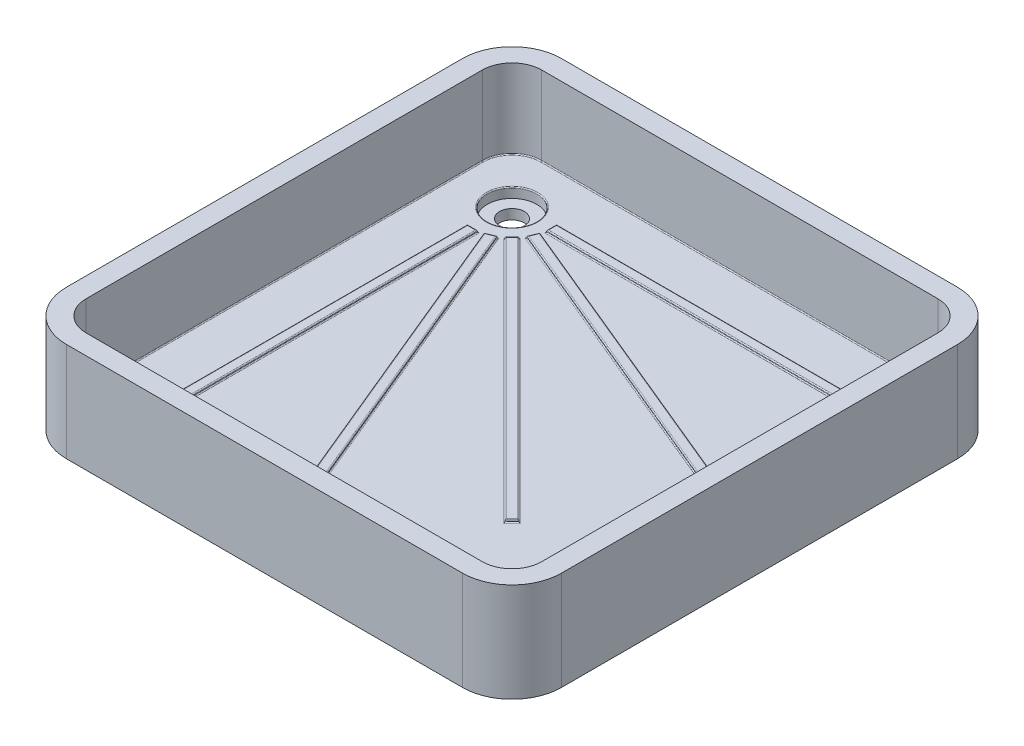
ISO-10303-21;
HEADER;
FILE_DESCRIPTION(('STEP AP214'),'2;1');
FILE_NAME('part.step','',(''),(''),'','','');
FILE_SCHEMA(('AUTOMOTIVE_DESIGN { 1 0 10303 214 1 1 1 1 }'));
ENDSEC;
DATA;
#1=APPLICATION_CONTEXT('core data for automotive mechanical design processes');
#2=APPLICATION_PROTOCOL_DEFINITION('international standard','automotive_design',2000,#1);
#3=PRODUCT_CONTEXT('',#1,'mechanical');
#4=PRODUCT('Part','Part','',(#3));
#5=PRODUCT_RELATED_PRODUCT_CATEGORY('part','',(#4));
#6=PRODUCT_DEFINITION_FORMATION('','',#4);
#7=PRODUCT_DEFINITION_CONTEXT('part definition',#1,'design');
#8=PRODUCT_DEFINITION('design','',#6,#7);
#9=PRODUCT_DEFINITION_SHAPE('','',#8);
#10=(LENGTH_UNIT() NAMED_UNIT(*) SI_UNIT(.MILLI.,.METRE.));
#11=(NAMED_UNIT(*) PLANE_ANGLE_UNIT() SI_UNIT($,.RADIAN.));
#12=(NAMED_UNIT(*) SI_UNIT($,.STERADIAN.) SOLID_ANGLE_UNIT());
#13=UNCERTAINTY_MEASURE_WITH_UNIT(LENGTH_MEASURE(1.E-05),#10,'distance_accuracy_value','');
#14=(GEOMETRIC_REPRESENTATION_CONTEXT(3) GLOBAL_UNCERTAINTY_ASSIGNED_CONTEXT((#13)) GLOBAL_UNIT_ASSIGNED_CONTEXT((#10,
#11,#12)) REPRESENTATION_CONTEXT('',''));
#15=CARTESIAN_POINT('',(0.,0.,0.));
#16=DIRECTION('',(0.,0.,1.));
#17=DIRECTION('',(1.,0.,0.));
#18=AXIS2_PLACEMENT_3D('',#15,#16,#17);
#19=CARTESIAN_POINT('',(0.,40.,0.));
#20=DIRECTION('',(0.,1.,0.));
#21=DIRECTION('',(0.,0.,1.));
#22=AXIS2_PLACEMENT_3D('',#19,#20,#21);
#23=PLANE('',#22);
#24=DIRECTION('',(0.,0.,-1.));
#25=VECTOR('',#24,1.);
#26=CARTESIAN_POINT('',(-338.000000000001,40.,-1.15331673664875E-12));
#27=LINE('',#26,#25);
#28=CARTESIAN_POINT('',(-338.,40.,-272.));
#29=VERTEX_POINT('',#28);
#30=CARTESIAN_POINT('',(-338.000000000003,40.,432.));
#31=VERTEX_POINT('',#30);
#32=EDGE_CURVE('E709',#29,#31,#27,.F.);
#33=ORIENTED_EDGE('',*,*,#32,.T.);
#34=DIRECTION('',(1.,0.,0.));
#35=VECTOR('',#34,1.);
#36=CARTESIAN_POINT('',(-1.50831993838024E-12,40.,432.000000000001));
#37=LINE('',#36,#35);
#38=CARTESIAN_POINT('',(-362.000000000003,40.,432.));
#39=VERTEX_POINT('',#38);
#40=EDGE_CURVE('E711',#31,#39,#37,.F.);
#41=ORIENTED_EDGE('',*,*,#40,.T.);
#42=DIRECTION('',(0.,0.,1.));
#43=VECTOR('',#42,1.);
#44=CARTESIAN_POINT('',(-362.000000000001,40.,-1.2352090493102E-12));
#45=LINE('',#44,#43);
#46=CARTESIAN_POINT('',(-362.,40.,-272.));
#47=VERTEX_POINT('',#46);
#48=EDGE_CURVE('E705',#39,#47,#45,.F.);
#49=ORIENTED_EDGE('',*,*,#48,.T.);
#50=DIRECTION('',(-1.,0.,0.));
#51=VECTOR('',#50,1.);
#52=CARTESIAN_POINT('',(1.94731267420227E-13,40.,-272.));
#53=LINE('',#52,#51);
#54=EDGE_CURVE('E707',#47,#29,#53,.F.);
#55=ORIENTED_EDGE('',*,*,#54,.T.);
#56=EDGE_LOOP('',(#33,#41,#49,#55));
#57=FACE_BOUND('',#56,.T.);
#58=DIRECTION('',(-0.382683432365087,0.,-0.923879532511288));
#59=VECTOR('',#58,1.);
#60=CARTESIAN_POINT('',(-163.913445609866,40.,67.8951722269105));
#61=LINE('',#60,#59);
#62=CARTESIAN_POINT('',(-309.064137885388,40.,-282.529597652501));
#63=VERTEX_POINT('',#62);
#64=CARTESIAN_POINT('',(-39.6550015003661,40.,367.881593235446));
#65=VERTEX_POINT('',#64);
#66=EDGE_CURVE('E700',#63,#65,#61,.F.);
#67=ORIENTED_EDGE('',*,*,#66,.T.);
#68=DIRECTION('',(0.923879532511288,0.,-0.382683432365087));
#69=VECTOR('',#68,1.);
#70=CARTESIAN_POINT('',(124.2584441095,40.,299.986421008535));
#71=LINE('',#70,#69);
#72=CARTESIAN_POINT('',(-61.828110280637,40.,377.065995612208));
#73=VERTEX_POINT('',#72);
#74=EDGE_CURVE('E702',#65,#73,#71,.F.);
#75=ORIENTED_EDGE('',*,*,#74,.T.);
#76=DIRECTION('',(0.382683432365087,0.,0.923879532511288));
#77=VECTOR('',#76,1.);
#78=CARTESIAN_POINT('',(-186.086554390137,40.,77.0795746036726));
#79=LINE('',#78,#77);
#80=CARTESIAN_POINT('',(-331.237246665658,40.,-273.345195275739));
#81=VERTEX_POINT('',#80);
#82=EDGE_CURVE('E696',#73,#81,#79,.F.);
#83=ORIENTED_EDGE('',*,*,#82,.T.);
#84=DIRECTION('',(-0.923879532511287,0.,0.38268343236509));
#85=VECTOR('',#84,1.);
#86=CARTESIAN_POINT('',(-145.150692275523,40.,-350.424769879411));
#87=LINE('',#86,#85);
#88=EDGE_CURVE('E698',#81,#63,#87,.F.);
#89=ORIENTED_EDGE('',*,*,#88,.T.);
#90=EDGE_LOOP('',(#67,#75,#83,#89));
#91=FACE_BOUND('',#90,.T.);
#92=DIRECTION('',(-0.707106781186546,0.,-0.707106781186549));
#93=VECTOR('',#92,1.);
#94=CARTESIAN_POINT('',(8.48528137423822,40.,-8.48528137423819));
#95=LINE('',#94,#93);
#96=CARTESIAN_POINT('',(-286.360389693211,40.,-303.330952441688));
#97=VERTEX_POINT('',#96);
#98=CARTESIAN_POINT('',(211.442784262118,40.,194.472221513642));
#99=VERTEX_POINT('',#98);
#100=EDGE_CURVE('E691',#97,#99,#95,.F.);
#101=ORIENTED_EDGE('',*,*,#100,.T.);
#102=DIRECTION('',(0.707106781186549,0.,-0.707106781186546));
#103=VECTOR('',#102,1.);
#104=CARTESIAN_POINT('',(202.95750288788,40.,202.95750288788));
#105=LINE('',#104,#103);
#106=CARTESIAN_POINT('',(194.472221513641,40.,211.442784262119));
#107=VERTEX_POINT('',#106);
#108=EDGE_CURVE('E693',#99,#107,#105,.F.);
#109=ORIENTED_EDGE('',*,*,#108,.T.);
#110=DIRECTION('',(0.707106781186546,0.,0.707106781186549));
#111=VECTOR('',#110,1.);
#112=CARTESIAN_POINT('',(-8.485281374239,40.,8.48528137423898));
#113=LINE('',#112,#111);
#114=CARTESIAN_POINT('',(-303.330952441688,40.,-286.360389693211));
#115=VERTEX_POINT('',#114);
#116=EDGE_CURVE('E687',#107,#115,#113,.F.);
#117=ORIENTED_EDGE('',*,*,#116,.T.);
#118=DIRECTION('',(-0.707106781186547,0.,0.707106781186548));
#119=VECTOR('',#118,1.);
#120=CARTESIAN_POINT('',(-294.84567106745,40.,-294.845671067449));
#121=LINE('',#120,#119);
#122=EDGE_CURVE('E689',#115,#97,#121,.F.);
#123=ORIENTED_EDGE('',*,*,#122,.T.);
#124=EDGE_LOOP('',(#101,#109,#117,#123));
#125=FACE_BOUND('',#124,.T.);
#126=DIRECTION('',(-0.923879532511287,0.,-0.382683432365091));
#127=VECTOR('',#126,1.);
#128=CARTESIAN_POINT('',(77.0795746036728,40.,-186.086554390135));
#129=LINE('',#128,#127);
#130=CARTESIAN_POINT('',(-273.345195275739,40.,-331.237246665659));
#131=VERTEX_POINT('',#130);
#132=CARTESIAN_POINT('',(377.065995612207,40.,-61.8281102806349));
#133=VERTEX_POINT('',#132);
#134=EDGE_CURVE('E682',#131,#133,#129,.F.);
#135=ORIENTED_EDGE('',*,*,#134,.T.);
#136=DIRECTION('',(0.382683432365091,0.,-0.923879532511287));
#137=VECTOR('',#136,1.);
#138=CARTESIAN_POINT('',(299.986421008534,40.,124.2584441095));
#139=LINE('',#138,#137);
#140=CARTESIAN_POINT('',(367.881593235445,40.,-39.655001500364));
#141=VERTEX_POINT('',#140);
#142=EDGE_CURVE('E684',#133,#141,#139,.F.);
#143=ORIENTED_EDGE('',*,*,#142,.T.);
#144=DIRECTION('',(0.923879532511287,0.,0.382683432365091));
#145=VECTOR('',#144,1.);
#146=CARTESIAN_POINT('',(67.8951722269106,40.,-163.913445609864));
#147=LINE('',#146,#145);
#148=CARTESIAN_POINT('',(-282.529597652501,40.,-309.064137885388));
#149=VERTEX_POINT('',#148);
#150=EDGE_CURVE('E678',#141,#149,#147,.F.);
#151=ORIENTED_EDGE('',*,*,#150,.T.);
#152=DIRECTION('',(-0.382683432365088,0.,0.923879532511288));
#153=VECTOR('',#152,1.);
#154=CARTESIAN_POINT('',(-350.424769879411,40.,-145.150692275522));
#155=LINE('',#154,#153);
#156=EDGE_CURVE('E680',#149,#131,#155,.F.);
#157=ORIENTED_EDGE('',*,*,#156,.T.);
#158=EDGE_LOOP('',(#135,#143,#151,#157));
#159=FACE_BOUND('',#158,.T.);
#160=DIRECTION('',(-1.,0.,0.));
#161=VECTOR('',#160,1.);
#162=CARTESIAN_POINT('',(0.,40.,-362.));
#163=LINE('',#162,#161);
#164=CARTESIAN_POINT('',(-272.,40.,-362.));
#165=VERTEX_POINT('',#164);
#166=CARTESIAN_POINT('',(432.,40.,-362.));
#167=VERTEX_POINT('',#166);
#168=EDGE_CURVE('E673',#165,#167,#163,.F.);
#169=ORIENTED_EDGE('',*,*,#168,.T.);
#170=DIRECTION('',(0.,0.,-1.));
#171=VECTOR('',#170,1.);
#172=CARTESIAN_POINT('',(432.,40.,0.));
#173=LINE('',#172,#171);
#174=CARTESIAN_POINT('',(432.,40.,-338.));
#175=VERTEX_POINT('',#174);
#176=EDGE_CURVE('E675',#167,#175,#173,.F.);
#177=ORIENTED_EDGE('',*,*,#176,.T.);
#178=DIRECTION('',(1.,0.,0.));
#179=VECTOR('',#178,1.);
#180=CARTESIAN_POINT('',(0.,40.,-338.));
#181=LINE('',#180,#179);
#182=CARTESIAN_POINT('',(-272.,40.,-338.));
#183=VERTEX_POINT('',#182);
#184=EDGE_CURVE('E669',#175,#183,#181,.F.);
#185=ORIENTED_EDGE('',*,*,#184,.T.);
#186=DIRECTION('',(0.,0.,1.));
#187=VECTOR('',#186,1.);
#188=CARTESIAN_POINT('',(-271.999999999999,40.,7.54951656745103E-13));
#189=LINE('',#188,#187);
#190=EDGE_CURVE('E671',#183,#165,#189,.F.);
#191=ORIENTED_EDGE('',*,*,#190,.T.);
#192=EDGE_LOOP('',(#169,#177,#185,#191));
#193=FACE_BOUND('',#192,.T.);
#194=DIRECTION('',(-1.,0.,0.));
#195=VECTOR('',#194,1.);
#196=CARTESIAN_POINT('',(-400.,40.,-458.));
#197=LINE('',#196,#195);
#198=CARTESIAN_POINT('',(400.,40.,-458.));
#199=VERTEX_POINT('',#198);
#200=CARTESIAN_POINT('',(-400.,40.,-458.));
#201=VERTEX_POINT('',#200);
#202=EDGE_CURVE('E664',#199,#201,#197,.T.);
#203=ORIENTED_EDGE('',*,*,#202,.T.);
#204=CARTESIAN_POINT('',(-400.,40.,-400.));
#205=DIRECTION('',(0.,1.,0.));
#206=DIRECTION('',(0.,0.,1.));
#207=AXIS2_PLACEMENT_3D('',#204,#205,#206);
#208=CIRCLE('',#207,58.);
#209=CARTESIAN_POINT('',(-458.,40.,-400.));
#210=VERTEX_POINT('',#209);
#211=EDGE_CURVE('E666',#201,#210,#208,.T.);
#212=ORIENTED_EDGE('',*,*,#211,.T.);
#213=DIRECTION('',(0.,0.,1.));
#214=VECTOR('',#213,1.);
#215=CARTESIAN_POINT('',(-458.,40.,400.));
#216=LINE('',#215,#214);
#217=CARTESIAN_POINT('',(-458.,40.,400.));
#218=VERTEX_POINT('',#217);
#219=EDGE_CURVE('E652',#210,#218,#216,.T.);
#220=ORIENTED_EDGE('',*,*,#219,.T.);
#221=CARTESIAN_POINT('',(-400.,40.,400.));
#222=DIRECTION('',(0.,1.,0.));
#223=DIRECTION('',(0.,0.,1.));
#224=AXIS2_PLACEMENT_3D('',#221,#222,#223);
#225=CIRCLE('',#224,58.);
#226=CARTESIAN_POINT('',(-400.,40.,458.));
#227=VERTEX_POINT('',#226);
#228=EDGE_CURVE('E654',#218,#227,#225,.T.);
#229=ORIENTED_EDGE('',*,*,#228,.T.);
#230=DIRECTION('',(1.,0.,0.));
#231=VECTOR('',#230,1.);
#232=CARTESIAN_POINT('',(400.,40.,458.));
#233=LINE('',#232,#231);
#234=CARTESIAN_POINT('',(400.,40.,458.));
#235=VERTEX_POINT('',#234);
#236=EDGE_CURVE('E656',#227,#235,#233,.T.);
#237=ORIENTED_EDGE('',*,*,#236,.T.);
#238=CARTESIAN_POINT('',(400.,40.,400.));
#239=DIRECTION('',(0.,1.,0.));
#240=DIRECTION('',(0.,0.,1.));
#241=AXIS2_PLACEMENT_3D('',#238,#239,#240);
#242=CIRCLE('',#241,58.);
#243=CARTESIAN_POINT('',(458.,40.,400.));
#244=VERTEX_POINT('',#243);
#245=EDGE_CURVE('E658',#235,#244,#242,.T.);
#246=ORIENTED_EDGE('',*,*,#245,.T.);
#247=DIRECTION('',(0.,0.,-1.));
#248=VECTOR('',#247,1.);
#249=CARTESIAN_POINT('',(458.,40.,-400.));
#250=LINE('',#249,#248);
#251=CARTESIAN_POINT('',(458.,40.,-400.));
#252=VERTEX_POINT('',#251);
#253=EDGE_CURVE('E660',#244,#252,#250,.T.);
#254=ORIENTED_EDGE('',*,*,#253,.T.);
#255=CARTESIAN_POINT('',(400.,40.,-400.));
#256=DIRECTION('',(0.,1.,0.));
#257=DIRECTION('',(0.,0.,1.));
#258=AXIS2_PLACEMENT_3D('',#255,#256,#257);
#259=CIRCLE('',#258,58.);
#260=EDGE_CURVE('E662',#252,#199,#259,.T.);
#261=ORIENTED_EDGE('',*,*,#260,.T.);
#262=EDGE_LOOP('',(#203,#212,#220,#229,#237,#246,#254,#261));
#263=FACE_BOUND('',#262,.T.);
#264=CARTESIAN_POINT('',(-350.,40.,-350.));
#265=DIRECTION('',(0.,1.,0.));
#266=DIRECTION('',(0.,0.,1.));
#267=AXIS2_PLACEMENT_3D('',#264,#265,#266);
#268=CIRCLE('',#267,52.);
#269=CARTESIAN_POINT('',(-350.,40.,-298.));
#270=VERTEX_POINT('',#269);
#271=EDGE_CURVE('E649',#270,#270,#268,.F.);
#272=ORIENTED_EDGE('',*,*,#271,.T.);
#273=EDGE_LOOP('',(#272));
#274=FACE_BOUND('',#273,.T.);
#275=ADVANCED_FACE('F32',(#57,#91,#125,#159,#193,#263,#274),#23,.T.);
#276=CARTESIAN_POINT('',(-500.,200.,500.));
#277=DIRECTION('',(1.,0.,0.));
#278=DIRECTION('',(0.,0.,-1.));
#279=AXIS2_PLACEMENT_3D('',#276,#277,#278);
#280=PLANE('',#279);
#281=DIRECTION('',(0.,0.,1.));
#282=VECTOR('',#281,1.);
#283=CARTESIAN_POINT('',(-500.,200.,500.));
#284=LINE('',#283,#282);
#285=CARTESIAN_POINT('',(-500.,200.,-400.));
#286=VERTEX_POINT('',#285);
#287=CARTESIAN_POINT('',(-500.,200.,400.));
#288=VERTEX_POINT('',#287);
#289=EDGE_CURVE('E453',#286,#288,#284,.T.);
#290=ORIENTED_EDGE('',*,*,#289,.F.);
#291=DIRECTION('',(0.,-1.,0.));
#292=VECTOR('',#291,1.);
#293=CARTESIAN_POINT('',(-500.,200.,-400.));
#294=LINE('',#293,#292);
#295=CARTESIAN_POINT('',(-500.,0.,-400.));
#296=VERTEX_POINT('',#295);
#297=EDGE_CURVE('E480',#286,#296,#294,.T.);
#298=ORIENTED_EDGE('',*,*,#297,.T.);
#299=DIRECTION('',(0.,0.,1.));
#300=VECTOR('',#299,1.);
#301=CARTESIAN_POINT('',(-500.,0.,500.));
#302=LINE('',#301,#300);
#303=CARTESIAN_POINT('',(-500.,0.,400.));
#304=VERTEX_POINT('',#303);
#305=EDGE_CURVE('E467',#296,#304,#302,.T.);
#306=ORIENTED_EDGE('',*,*,#305,.T.);
#307=DIRECTION('',(0.,-1.,0.));
#308=VECTOR('',#307,1.);
#309=CARTESIAN_POINT('',(-500.,200.,400.));
#310=LINE('',#309,#308);
#311=EDGE_CURVE('E466',#304,#288,#310,.F.);
#312=ORIENTED_EDGE('',*,*,#311,.T.);
#313=EDGE_LOOP('',(#290,#298,#306,#312));
#314=FACE_BOUND('',#313,.T.);
#315=ADVANCED_FACE('F913',(#314),#280,.F.);
#316=CARTESIAN_POINT('',(500.,200.,500.));
#317=DIRECTION('',(0.,0.,-1.));
#318=DIRECTION('',(-1.,0.,0.));
#319=AXIS2_PLACEMENT_3D('',#316,#317,#318);
#320=PLANE('',#319);
#321=DIRECTION('',(1.,0.,0.));
#322=VECTOR('',#321,1.);
#323=CARTESIAN_POINT('',(500.,200.,500.));
#324=LINE('',#323,#322);
#325=CARTESIAN_POINT('',(-400.,200.,500.));
#326=VERTEX_POINT('',#325);
#327=CARTESIAN_POINT('',(400.,200.,500.));
#328=VERTEX_POINT('',#327);
#329=EDGE_CURVE('E456',#326,#328,#324,.T.);
#330=ORIENTED_EDGE('',*,*,#329,.F.);
#331=DIRECTION('',(0.,-1.,0.));
#332=VECTOR('',#331,1.);
#333=CARTESIAN_POINT('',(-400.,200.,500.));
#334=LINE('',#333,#332);
#335=CARTESIAN_POINT('',(-400.,0.,500.));
#336=VERTEX_POINT('',#335);
#337=EDGE_CURVE('E511',#326,#336,#334,.T.);
#338=ORIENTED_EDGE('',*,*,#337,.T.);
#339=DIRECTION('',(1.,0.,0.));
#340=VECTOR('',#339,1.);
#341=CARTESIAN_POINT('',(500.,0.,500.));
#342=LINE('',#341,#340);
#343=CARTESIAN_POINT('',(400.,0.,500.));
#344=VERTEX_POINT('',#343);
#345=EDGE_CURVE('E470',#336,#344,#342,.T.);
#346=ORIENTED_EDGE('',*,*,#345,.T.);
#347=DIRECTION('',(0.,-1.,0.));
#348=VECTOR('',#347,1.);
#349=CARTESIAN_POINT('',(400.,200.,500.));
#350=LINE('',#349,#348);
#351=EDGE_CURVE('E509',#344,#328,#350,.F.);
#352=ORIENTED_EDGE('',*,*,#351,.T.);
#353=EDGE_LOOP('',(#330,#338,#346,#352));
#354=FACE_BOUND('',#353,.T.);
#355=ADVANCED_FACE('F919',(#354),#320,.F.);
#356=CARTESIAN_POINT('',(500.,200.,500.));
#357=DIRECTION('',(-1.,0.,0.));
#358=DIRECTION('',(0.,0.,1.));
#359=AXIS2_PLACEMENT_3D('',#356,#357,#358);
#360=PLANE('',#359);
#361=DIRECTION('',(0.,0.,-1.));
#362=VECTOR('',#361,1.);
#363=CARTESIAN_POINT('',(500.,0.,500.));
#364=LINE('',#363,#362);
#365=CARTESIAN_POINT('',(500.,0.,400.));
#366=VERTEX_POINT('',#365);
#367=CARTESIAN_POINT('',(500.,0.,-400.));
#368=VERTEX_POINT('',#367);
#369=EDGE_CURVE('E474',#366,#368,#364,.T.);
#370=ORIENTED_EDGE('',*,*,#369,.T.);
#371=DIRECTION('',(0.,-1.,0.));
#372=VECTOR('',#371,1.);
#373=CARTESIAN_POINT('',(500.,200.,-400.));
#374=LINE('',#373,#372);
#375=CARTESIAN_POINT('',(500.,200.,-400.));
#376=VERTEX_POINT('',#375);
#377=EDGE_CURVE('E507',#368,#376,#374,.F.);
#378=ORIENTED_EDGE('',*,*,#377,.T.);
#379=DIRECTION('',(0.,0.,-1.));
#380=VECTOR('',#379,1.);
#381=CARTESIAN_POINT('',(500.,200.,500.));
#382=LINE('',#381,#380);
#383=CARTESIAN_POINT('',(500.,200.,400.));
#384=VERTEX_POINT('',#383);
#385=EDGE_CURVE('E460',#384,#376,#382,.T.);
#386=ORIENTED_EDGE('',*,*,#385,.F.);
#387=DIRECTION('',(0.,-1.,0.));
#388=VECTOR('',#387,1.);
#389=CARTESIAN_POINT('',(500.,200.,400.));
#390=LINE('',#389,#388);
#391=EDGE_CURVE('E504',#384,#366,#390,.T.);
#392=ORIENTED_EDGE('',*,*,#391,.T.);
#393=EDGE_LOOP('',(#370,#378,#386,#392));
#394=FACE_BOUND('',#393,.T.);
#395=ADVANCED_FACE('F944',(#394),#360,.F.);
#396=CARTESIAN_POINT('',(500.,200.,-500.));
#397=DIRECTION('',(0.,0.,1.));
#398=DIRECTION('',(1.,0.,0.));
#399=AXIS2_PLACEMENT_3D('',#396,#397,#398);
#400=PLANE('',#399);
#401=DIRECTION('',(-1.,0.,0.));
#402=VECTOR('',#401,1.);
#403=CARTESIAN_POINT('',(500.,0.,-500.));
#404=LINE('',#403,#402);
#405=CARTESIAN_POINT('',(400.,0.,-500.));
#406=VERTEX_POINT('',#405);
#407=CARTESIAN_POINT('',(-400.,0.,-500.));
#408=VERTEX_POINT('',#407);
#409=EDGE_CURVE('E457',#406,#408,#404,.T.);
#410=ORIENTED_EDGE('',*,*,#409,.T.);
#411=DIRECTION('',(0.,-1.,0.));
#412=VECTOR('',#411,1.);
#413=CARTESIAN_POINT('',(-400.,200.,-500.));
#414=LINE('',#413,#412);
#415=CARTESIAN_POINT('',(-400.,200.,-500.));
#416=VERTEX_POINT('',#415);
#417=EDGE_CURVE('E494',#408,#416,#414,.F.);
#418=ORIENTED_EDGE('',*,*,#417,.T.);
#419=DIRECTION('',(-1.,0.,0.));
#420=VECTOR('',#419,1.);
#421=CARTESIAN_POINT('',(500.,200.,-500.));
#422=LINE('',#421,#420);
#423=CARTESIAN_POINT('',(400.,200.,-500.));
#424=VERTEX_POINT('',#423);
#425=EDGE_CURVE('E463',#424,#416,#422,.T.);
#426=ORIENTED_EDGE('',*,*,#425,.F.);
#427=DIRECTION('',(0.,-1.,0.));
#428=VECTOR('',#427,1.);
#429=CARTESIAN_POINT('',(400.,200.,-500.));
#430=LINE('',#429,#428);
#431=EDGE_CURVE('E491',#424,#406,#430,.T.);
#432=ORIENTED_EDGE('',*,*,#431,.T.);
#433=EDGE_LOOP('',(#410,#418,#426,#432));
#434=FACE_BOUND('',#433,.T.);
#435=ADVANCED_FACE('F937',(#434),#400,.F.);
#436=CARTESIAN_POINT('',(0.,200.,0.));
#437=DIRECTION('',(0.,1.,0.));
#438=DIRECTION('',(0.,0.,1.));
#439=AXIS2_PLACEMENT_3D('',#436,#437,#438);
#440=PLANE('',#439);
#441=DIRECTION('',(-1.,0.,0.));
#442=VECTOR('',#441,1.);
#443=CARTESIAN_POINT('',(500.,200.,-460.));
#444=LINE('',#443,#442);
#445=CARTESIAN_POINT('',(400.,200.,-460.));
#446=VERTEX_POINT('',#445);
#447=CARTESIAN_POINT('',(-400.,200.,-460.));
#448=VERTEX_POINT('',#447);
#449=EDGE_CURVE('E418',#446,#448,#444,.T.);
#450=ORIENTED_EDGE('',*,*,#449,.F.);
#451=CARTESIAN_POINT('',(400.,200.,-400.));
#452=DIRECTION('',(0.,1.,0.));
#453=DIRECTION('',(0.,0.,1.));
#454=AXIS2_PLACEMENT_3D('',#451,#452,#453);
#455=CIRCLE('',#454,60.);
#456=CARTESIAN_POINT('',(460.,200.,-400.));
#457=VERTEX_POINT('',#456);
#458=EDGE_CURVE('E436',#457,#446,#455,.T.);
#459=ORIENTED_EDGE('',*,*,#458,.F.);
#460=DIRECTION('',(0.,0.,-1.));
#461=VECTOR('',#460,1.);
#462=CARTESIAN_POINT('',(460.,200.,500.));
#463=LINE('',#462,#461);
#464=CARTESIAN_POINT('',(460.,200.,400.));
#465=VERTEX_POINT('',#464);
#466=EDGE_CURVE('E445',#465,#457,#463,.T.);
#467=ORIENTED_EDGE('',*,*,#466,.F.);
#468=CARTESIAN_POINT('',(400.,200.,400.));
#469=DIRECTION('',(0.,1.,0.));
#470=DIRECTION('',(0.,0.,1.));
#471=AXIS2_PLACEMENT_3D('',#468,#469,#470);
#472=CIRCLE('',#471,60.);
#473=CARTESIAN_POINT('',(400.,200.,460.));
#474=VERTEX_POINT('',#473);
#475=EDGE_CURVE('E437',#474,#465,#472,.T.);
#476=ORIENTED_EDGE('',*,*,#475,.F.);
#477=DIRECTION('',(1.,0.,0.));
#478=VECTOR('',#477,1.);
#479=CARTESIAN_POINT('',(500.,200.,460.));
#480=LINE('',#479,#478);
#481=CARTESIAN_POINT('',(-400.,200.,460.));
#482=VERTEX_POINT('',#481);
#483=EDGE_CURVE('E427',#482,#474,#480,.T.);
#484=ORIENTED_EDGE('',*,*,#483,.F.);
#485=CARTESIAN_POINT('',(-400.,200.,400.));
#486=DIRECTION('',(0.,1.,0.));
#487=DIRECTION('',(0.,0.,1.));
#488=AXIS2_PLACEMENT_3D('',#485,#486,#487);
#489=CIRCLE('',#488,60.);
#490=CARTESIAN_POINT('',(-460.,200.,400.));
#491=VERTEX_POINT('',#490);
#492=EDGE_CURVE('E414',#491,#482,#489,.T.);
#493=ORIENTED_EDGE('',*,*,#492,.F.);
#494=DIRECTION('',(0.,0.,1.));
#495=VECTOR('',#494,1.);
#496=CARTESIAN_POINT('',(-460.,200.,500.));
#497=LINE('',#496,#495);
#498=CARTESIAN_POINT('',(-460.,200.,-400.));
#499=VERTEX_POINT('',#498);
#500=EDGE_CURVE('E422',#499,#491,#497,.T.);
#501=ORIENTED_EDGE('',*,*,#500,.F.);
#502=CARTESIAN_POINT('',(-400.,200.,-400.));
#503=DIRECTION('',(0.,1.,0.));
#504=DIRECTION('',(0.,0.,1.));
#505=AXIS2_PLACEMENT_3D('',#502,#503,#504);
#506=CIRCLE('',#505,60.);
#507=EDGE_CURVE('E439',#448,#499,#506,.T.);
#508=ORIENTED_EDGE('',*,*,#507,.F.);
#509=EDGE_LOOP('',(#450,#459,#467,#476,#484,#493,#501,#508));
#510=FACE_BOUND('',#509,.T.);
#511=ORIENTED_EDGE('',*,*,#425,.T.);
#512=CARTESIAN_POINT('',(-400.,200.,-400.));
#513=DIRECTION('',(0.,1.,0.));
#514=DIRECTION('',(0.,0.,1.));
#515=AXIS2_PLACEMENT_3D('',#512,#513,#514);
#516=CIRCLE('',#515,100.);
#517=EDGE_CURVE('E502',#416,#286,#516,.T.);
#518=ORIENTED_EDGE('',*,*,#517,.T.);
#519=ORIENTED_EDGE('',*,*,#289,.T.);
#520=CARTESIAN_POINT('',(-400.,200.,400.));
#521=DIRECTION('',(0.,1.,0.));
#522=DIRECTION('',(0.,0.,1.));
#523=AXIS2_PLACEMENT_3D('',#520,#521,#522);
#524=CIRCLE('',#523,100.);
#525=EDGE_CURVE('E498',#288,#326,#524,.T.);
#526=ORIENTED_EDGE('',*,*,#525,.T.);
#527=ORIENTED_EDGE('',*,*,#329,.T.);
#528=CARTESIAN_POINT('',(400.,200.,400.));
#529=DIRECTION('',(0.,1.,0.));
#530=DIRECTION('',(0.,0.,1.));
#531=AXIS2_PLACEMENT_3D('',#528,#529,#530);
#532=CIRCLE('',#531,100.);
#533=EDGE_CURVE('E496',#328,#384,#532,.T.);
#534=ORIENTED_EDGE('',*,*,#533,.T.);
#535=ORIENTED_EDGE('',*,*,#385,.T.);
#536=CARTESIAN_POINT('',(400.,200.,-400.));
#537=DIRECTION('',(0.,1.,0.));
#538=DIRECTION('',(0.,0.,1.));
#539=AXIS2_PLACEMENT_3D('',#536,#537,#538);
#540=CIRCLE('',#539,100.);
#541=EDGE_CURVE('E500',#376,#424,#540,.T.);
#542=ORIENTED_EDGE('',*,*,#541,.T.);
#543=EDGE_LOOP('',(#511,#518,#519,#526,#527,#534,#535,#542));
#544=FACE_BOUND('',#543,.T.);
#545=ADVANCED_FACE('F432',(#510,#544),#440,.T.);
#546=CARTESIAN_POINT('',(0.,0.,0.));
#547=DIRECTION('',(0.,1.,0.));
#548=DIRECTION('',(0.,0.,1.));
#549=AXIS2_PLACEMENT_3D('',#546,#547,#548);
#550=PLANE('',#549);
#551=CARTESIAN_POINT('',(-350.,0.,-350.));
#552=DIRECTION('',(0.,1.,0.));
#553=DIRECTION('',(0.,0.,1.));
#554=AXIS2_PLACEMENT_3D('',#551,#552,#553);
#555=CIRCLE('',#554,25.);
#556=CARTESIAN_POINT('',(-350.,0.,-325.));
#557=VERTEX_POINT('',#556);
#558=EDGE_CURVE('E1838',#557,#557,#555,.T.);
#559=ORIENTED_EDGE('',*,*,#558,.T.);
#560=EDGE_LOOP('',(#559));
#561=FACE_BOUND('',#560,.T.);
#562=ORIENTED_EDGE('',*,*,#305,.F.);
#563=CARTESIAN_POINT('',(-400.,0.,-400.));
#564=DIRECTION('',(0.,1.,0.));
#565=DIRECTION('',(0.,0.,1.));
#566=AXIS2_PLACEMENT_3D('',#563,#564,#565);
#567=CIRCLE('',#566,100.);
#568=EDGE_CURVE('E489',#296,#408,#567,.F.);
#569=ORIENTED_EDGE('',*,*,#568,.T.);
#570=ORIENTED_EDGE('',*,*,#409,.F.);
#571=CARTESIAN_POINT('',(400.,0.,-400.));
#572=DIRECTION('',(0.,1.,0.));
#573=DIRECTION('',(0.,0.,1.));
#574=AXIS2_PLACEMENT_3D('',#571,#572,#573);
#575=CIRCLE('',#574,100.);
#576=EDGE_CURVE('E487',#406,#368,#575,.F.);
#577=ORIENTED_EDGE('',*,*,#576,.T.);
#578=ORIENTED_EDGE('',*,*,#369,.F.);
#579=CARTESIAN_POINT('',(400.,0.,400.));
#580=DIRECTION('',(0.,1.,0.));
#581=DIRECTION('',(0.,0.,1.));
#582=AXIS2_PLACEMENT_3D('',#579,#580,#581);
#583=CIRCLE('',#582,100.);
#584=EDGE_CURVE('E483',#366,#344,#583,.F.);
#585=ORIENTED_EDGE('',*,*,#584,.T.);
#586=ORIENTED_EDGE('',*,*,#345,.F.);
#587=CARTESIAN_POINT('',(-400.,0.,400.));
#588=DIRECTION('',(0.,1.,0.));
#589=DIRECTION('',(0.,0.,1.));
#590=AXIS2_PLACEMENT_3D('',#587,#588,#589);
#591=CIRCLE('',#590,100.);
#592=EDGE_CURVE('E485',#336,#304,#591,.F.);
#593=ORIENTED_EDGE('',*,*,#592,.T.);
#594=EDGE_LOOP('',(#562,#569,#570,#577,#578,#585,#586,#593));
#595=FACE_BOUND('',#594,.T.);
#596=ADVANCED_FACE('F936',(#561,#595),#550,.F.);
#597=CARTESIAN_POINT('',(-400.,200.,-400.));
#598=DIRECTION('',(0.,-1.,0.));
#599=DIRECTION('',(0.,0.,-1.));
#600=AXIS2_PLACEMENT_3D('',#597,#598,#599);
#601=CYLINDRICAL_SURFACE('',#600,100.);
#602=ORIENTED_EDGE('',*,*,#517,.F.);
#603=ORIENTED_EDGE('',*,*,#417,.F.);
#604=ORIENTED_EDGE('',*,*,#568,.F.);
#605=ORIENTED_EDGE('',*,*,#297,.F.);
#606=EDGE_LOOP('',(#602,#603,#604,#605));
#607=FACE_BOUND('',#606,.T.);
#608=ADVANCED_FACE('F940',(#607),#601,.T.);
#609=CARTESIAN_POINT('',(400.,200.,-400.));
#610=DIRECTION('',(0.,-1.,0.));
#611=DIRECTION('',(0.,0.,-1.));
#612=AXIS2_PLACEMENT_3D('',#609,#610,#611);
#613=CYLINDRICAL_SURFACE('',#612,100.);
#614=ORIENTED_EDGE('',*,*,#541,.F.);
#615=ORIENTED_EDGE('',*,*,#377,.F.);
#616=ORIENTED_EDGE('',*,*,#576,.F.);
#617=ORIENTED_EDGE('',*,*,#431,.F.);
#618=EDGE_LOOP('',(#614,#615,#616,#617));
#619=FACE_BOUND('',#618,.T.);
#620=ADVANCED_FACE('F954',(#619),#613,.T.);
#621=CARTESIAN_POINT('',(-400.,200.,400.));
#622=DIRECTION('',(0.,-1.,0.));
#623=DIRECTION('',(0.,0.,-1.));
#624=AXIS2_PLACEMENT_3D('',#621,#622,#623);
#625=CYLINDRICAL_SURFACE('',#624,100.);
#626=ORIENTED_EDGE('',*,*,#525,.F.);
#627=ORIENTED_EDGE('',*,*,#311,.F.);
#628=ORIENTED_EDGE('',*,*,#592,.F.);
#629=ORIENTED_EDGE('',*,*,#337,.F.);
#630=EDGE_LOOP('',(#626,#627,#628,#629));
#631=FACE_BOUND('',#630,.T.);
#632=ADVANCED_FACE('F958',(#631),#625,.T.);
#633=CARTESIAN_POINT('',(400.,200.,400.));
#634=DIRECTION('',(0.,-1.,0.));
#635=DIRECTION('',(0.,0.,-1.));
#636=AXIS2_PLACEMENT_3D('',#633,#634,#635);
#637=CYLINDRICAL_SURFACE('',#636,100.);
#638=ORIENTED_EDGE('',*,*,#533,.F.);
#639=ORIENTED_EDGE('',*,*,#351,.F.);
#640=ORIENTED_EDGE('',*,*,#584,.F.);
#641=ORIENTED_EDGE('',*,*,#391,.F.);
#642=EDGE_LOOP('',(#638,#639,#640,#641));
#643=FACE_BOUND('',#642,.T.);
#644=ADVANCED_FACE('F910',(#643),#637,.T.);
#645=CARTESIAN_POINT('',(-460.,200.,500.));
#646=DIRECTION('',(1.,0.,0.));
#647=DIRECTION('',(0.,0.,-1.));
#648=AXIS2_PLACEMENT_3D('',#645,#646,#647);
#649=PLANE('',#648);
#650=DIRECTION('',(0.,1.,0.));
#651=VECTOR('',#650,1.);
#652=CARTESIAN_POINT('',(-460.,200.,400.));
#653=LINE('',#652,#651);
#654=CARTESIAN_POINT('',(-460.,42.,400.));
#655=VERTEX_POINT('',#654);
#656=EDGE_CURVE('E410',#655,#491,#653,.T.);
#657=ORIENTED_EDGE('',*,*,#656,.F.);
#658=DIRECTION('',(0.,0.,1.));
#659=VECTOR('',#658,1.);
#660=CARTESIAN_POINT('',(-460.,42.,-400.));
#661=LINE('',#660,#659);
#662=CARTESIAN_POINT('',(-460.,42.,-400.));
#663=VERTEX_POINT('',#662);
#664=EDGE_CURVE('E41',#655,#663,#661,.F.);
#665=ORIENTED_EDGE('',*,*,#664,.T.);
#666=DIRECTION('',(0.,1.,0.));
#667=VECTOR('',#666,1.);
#668=CARTESIAN_POINT('',(-460.,200.,-400.));
#669=LINE('',#668,#667);
#670=EDGE_CURVE('E417',#499,#663,#669,.F.);
#671=ORIENTED_EDGE('',*,*,#670,.F.);
#672=ORIENTED_EDGE('',*,*,#500,.T.);
#673=EDGE_LOOP('',(#657,#665,#671,#672));
#674=FACE_BOUND('',#673,.T.);
#675=ADVANCED_FACE('F423',(#674),#649,.T.);
#676=CARTESIAN_POINT('',(500.,200.,460.));
#677=DIRECTION('',(0.,0.,-1.));
#678=DIRECTION('',(-1.,0.,0.));
#679=AXIS2_PLACEMENT_3D('',#676,#677,#678);
#680=PLANE('',#679);
#681=DIRECTION('',(0.,1.,0.));
#682=VECTOR('',#681,1.);
#683=CARTESIAN_POINT('',(400.,200.,460.));
#684=LINE('',#683,#682);
#685=CARTESIAN_POINT('',(400.,42.,460.));
#686=VERTEX_POINT('',#685);
#687=EDGE_CURVE('E883',#686,#474,#684,.T.);
#688=ORIENTED_EDGE('',*,*,#687,.F.);
#689=DIRECTION('',(1.,0.,0.));
#690=VECTOR('',#689,1.);
#691=CARTESIAN_POINT('',(-400.,42.,460.));
#692=LINE('',#691,#690);
#693=CARTESIAN_POINT('',(-400.,42.,460.));
#694=VERTEX_POINT('',#693);
#695=EDGE_CURVE('E57',#686,#694,#692,.F.);
#696=ORIENTED_EDGE('',*,*,#695,.T.);
#697=DIRECTION('',(0.,1.,0.));
#698=VECTOR('',#697,1.);
#699=CARTESIAN_POINT('',(-400.,200.,460.));
#700=LINE('',#699,#698);
#701=EDGE_CURVE('E471',#482,#694,#700,.F.);
#702=ORIENTED_EDGE('',*,*,#701,.F.);
#703=ORIENTED_EDGE('',*,*,#483,.T.);
#704=EDGE_LOOP('',(#688,#696,#702,#703));
#705=FACE_BOUND('',#704,.T.);
#706=ADVANCED_FACE('F902',(#705),#680,.T.);
#707=CARTESIAN_POINT('',(460.,200.,500.));
#708=DIRECTION('',(-1.,0.,0.));
#709=DIRECTION('',(0.,0.,1.));
#710=AXIS2_PLACEMENT_3D('',#707,#708,#709);
#711=PLANE('',#710);
#712=DIRECTION('',(0.,1.,0.));
#713=VECTOR('',#712,1.);
#714=CARTESIAN_POINT('',(460.,200.,-400.));
#715=LINE('',#714,#713);
#716=CARTESIAN_POINT('',(460.,42.,-400.));
#717=VERTEX_POINT('',#716);
#718=EDGE_CURVE('E885',#717,#457,#715,.T.);
#719=ORIENTED_EDGE('',*,*,#718,.F.);
#720=DIRECTION('',(0.,0.,-1.));
#721=VECTOR('',#720,1.);
#722=CARTESIAN_POINT('',(460.,42.,400.));
#723=LINE('',#722,#721);
#724=CARTESIAN_POINT('',(460.,42.,400.));
#725=VERTEX_POINT('',#724);
#726=EDGE_CURVE('E721',#717,#725,#723,.F.);
#727=ORIENTED_EDGE('',*,*,#726,.T.);
#728=DIRECTION('',(0.,1.,0.));
#729=VECTOR('',#728,1.);
#730=CARTESIAN_POINT('',(460.,200.,400.));
#731=LINE('',#730,#729);
#732=EDGE_CURVE('E452',#465,#725,#731,.F.);
#733=ORIENTED_EDGE('',*,*,#732,.F.);
#734=ORIENTED_EDGE('',*,*,#466,.T.);
#735=EDGE_LOOP('',(#719,#727,#733,#734));
#736=FACE_BOUND('',#735,.T.);
#737=ADVANCED_FACE('F899',(#736),#711,.T.);
#738=CARTESIAN_POINT('',(500.,200.,-460.));
#739=DIRECTION('',(0.,0.,1.));
#740=DIRECTION('',(1.,0.,0.));
#741=AXIS2_PLACEMENT_3D('',#738,#739,#740);
#742=PLANE('',#741);
#743=DIRECTION('',(0.,1.,0.));
#744=VECTOR('',#743,1.);
#745=CARTESIAN_POINT('',(-400.,200.,-460.));
#746=LINE('',#745,#744);
#747=CARTESIAN_POINT('',(-400.,42.,-460.));
#748=VERTEX_POINT('',#747);
#749=EDGE_CURVE('E441',#748,#448,#746,.T.);
#750=ORIENTED_EDGE('',*,*,#749,.F.);
#751=DIRECTION('',(-1.,0.,0.));
#752=VECTOR('',#751,1.);
#753=CARTESIAN_POINT('',(400.,42.,-460.));
#754=LINE('',#753,#752);
#755=CARTESIAN_POINT('',(400.,42.,-460.));
#756=VERTEX_POINT('',#755);
#757=EDGE_CURVE('E717',#748,#756,#754,.F.);
#758=ORIENTED_EDGE('',*,*,#757,.T.);
#759=DIRECTION('',(0.,1.,0.));
#760=VECTOR('',#759,1.);
#761=CARTESIAN_POINT('',(400.,200.,-460.));
#762=LINE('',#761,#760);
#763=EDGE_CURVE('E875',#446,#756,#762,.F.);
#764=ORIENTED_EDGE('',*,*,#763,.F.);
#765=ORIENTED_EDGE('',*,*,#449,.T.);
#766=EDGE_LOOP('',(#750,#758,#764,#765));
#767=FACE_BOUND('',#766,.T.);
#768=ADVANCED_FACE('F890',(#767),#742,.T.);
#769=CARTESIAN_POINT('',(-400.,200.,-400.));
#770=DIRECTION('',(0.,-1.,0.));
#771=DIRECTION('',(0.,0.,-1.));
#772=AXIS2_PLACEMENT_3D('',#769,#770,#771);
#773=CYLINDRICAL_SURFACE('',#772,60.);
#774=ORIENTED_EDGE('',*,*,#670,.T.);
#775=CARTESIAN_POINT('',(-400.,42.,-400.));
#776=DIRECTION('',(0.,1.,0.));
#777=DIRECTION('',(0.,0.,1.));
#778=AXIS2_PLACEMENT_3D('',#775,#776,#777);
#779=CIRCLE('',#778,60.);
#780=EDGE_CURVE('E714',#663,#748,#779,.F.);
#781=ORIENTED_EDGE('',*,*,#780,.T.);
#782=ORIENTED_EDGE('',*,*,#749,.T.);
#783=ORIENTED_EDGE('',*,*,#507,.T.);
#784=EDGE_LOOP('',(#774,#781,#782,#783));
#785=FACE_BOUND('',#784,.T.);
#786=ADVANCED_FACE('F873',(#785),#773,.F.);
#787=CARTESIAN_POINT('',(400.,200.,-400.));
#788=DIRECTION('',(0.,-1.,0.));
#789=DIRECTION('',(0.,0.,-1.));
#790=AXIS2_PLACEMENT_3D('',#787,#788,#789);
#791=CYLINDRICAL_SURFACE('',#790,60.);
#792=ORIENTED_EDGE('',*,*,#763,.T.);
#793=CARTESIAN_POINT('',(400.,42.,-400.));
#794=DIRECTION('',(0.,1.,0.));
#795=DIRECTION('',(0.,0.,1.));
#796=AXIS2_PLACEMENT_3D('',#793,#794,#795);
#797=CIRCLE('',#796,60.);
#798=EDGE_CURVE('E719',#756,#717,#797,.F.);
#799=ORIENTED_EDGE('',*,*,#798,.T.);
#800=ORIENTED_EDGE('',*,*,#718,.T.);
#801=ORIENTED_EDGE('',*,*,#458,.T.);
#802=EDGE_LOOP('',(#792,#799,#800,#801));
#803=FACE_BOUND('',#802,.T.);
#804=ADVANCED_FACE('F894',(#803),#791,.F.);
#805=CARTESIAN_POINT('',(-400.,200.,400.));
#806=DIRECTION('',(0.,-1.,0.));
#807=DIRECTION('',(0.,0.,-1.));
#808=AXIS2_PLACEMENT_3D('',#805,#806,#807);
#809=CYLINDRICAL_SURFACE('',#808,60.);
#810=ORIENTED_EDGE('',*,*,#701,.T.);
#811=CARTESIAN_POINT('',(-400.,42.,400.));
#812=DIRECTION('',(0.,1.,0.));
#813=DIRECTION('',(0.,0.,1.));
#814=AXIS2_PLACEMENT_3D('',#811,#812,#813);
#815=CIRCLE('',#814,60.);
#816=EDGE_CURVE('E49',#694,#655,#815,.F.);
#817=ORIENTED_EDGE('',*,*,#816,.T.);
#818=ORIENTED_EDGE('',*,*,#656,.T.);
#819=ORIENTED_EDGE('',*,*,#492,.T.);
#820=EDGE_LOOP('',(#810,#817,#818,#819));
#821=FACE_BOUND('',#820,.T.);
#822=ADVANCED_FACE('F412',(#821),#809,.F.);
#823=CARTESIAN_POINT('',(400.,200.,400.));
#824=DIRECTION('',(0.,-1.,0.));
#825=DIRECTION('',(0.,0.,-1.));
#826=AXIS2_PLACEMENT_3D('',#823,#824,#825);
#827=CYLINDRICAL_SURFACE('',#826,60.);
#828=ORIENTED_EDGE('',*,*,#732,.T.);
#829=CARTESIAN_POINT('',(400.,42.,400.));
#830=DIRECTION('',(0.,1.,0.));
#831=DIRECTION('',(0.,0.,1.));
#832=AXIS2_PLACEMENT_3D('',#829,#830,#831);
#833=CIRCLE('',#832,60.);
#834=EDGE_CURVE('E723',#725,#686,#833,.F.);
#835=ORIENTED_EDGE('',*,*,#834,.T.);
#836=ORIENTED_EDGE('',*,*,#687,.T.);
#837=ORIENTED_EDGE('',*,*,#475,.T.);
#838=EDGE_LOOP('',(#828,#835,#836,#837));
#839=FACE_BOUND('',#838,.T.);
#840=ADVANCED_FACE('F901',(#839),#827,.F.);
#841=CARTESIAN_POINT('',(-350.,20.,-350.));
#842=DIRECTION('',(0.,1.,0.));
#843=DIRECTION('',(0.,0.,1.));
#844=AXIS2_PLACEMENT_3D('',#841,#842,#843);
#845=CYLINDRICAL_SURFACE('',#844,50.);
#846=CARTESIAN_POINT('',(-350.,38.,-350.));
#847=DIRECTION('',(0.,1.,0.));
#848=DIRECTION('',(0.,0.,1.));
#849=AXIS2_PLACEMENT_3D('',#846,#847,#848);
#850=CIRCLE('',#849,50.);
#851=CARTESIAN_POINT('',(-350.,38.,-300.));
#852=VERTEX_POINT('',#851);
#853=EDGE_CURVE('E11',#852,#852,#850,.T.);
#854=ORIENTED_EDGE('',*,*,#853,.T.);
#855=EDGE_LOOP('',(#854));
#856=FACE_BOUND('',#855,.T.);
#857=CARTESIAN_POINT('',(-350.,20.,-350.));
#858=DIRECTION('',(0.,1.,0.));
#859=DIRECTION('',(0.,0.,1.));
#860=AXIS2_PLACEMENT_3D('',#857,#858,#859);
#861=CIRCLE('',#860,50.);
#862=CARTESIAN_POINT('',(-350.,20.,-300.));
#863=VERTEX_POINT('',#862);
#864=EDGE_CURVE('E428',#863,#863,#861,.T.);
#865=ORIENTED_EDGE('',*,*,#864,.F.);
#866=EDGE_LOOP('',(#865));
#867=FACE_BOUND('',#866,.T.);
#868=ADVANCED_FACE('F933',(#856,#867),#845,.F.);
#869=CARTESIAN_POINT('',(-350.,20.,-350.));
#870=DIRECTION('',(0.,1.,0.));
#871=DIRECTION('',(0.,0.,1.));
#872=AXIS2_PLACEMENT_3D('',#869,#870,#871);
#873=PLANE('',#872);
#874=CARTESIAN_POINT('',(-350.,20.,-350.));
#875=DIRECTION('',(0.,1.,0.));
#876=DIRECTION('',(0.,0.,1.));
#877=AXIS2_PLACEMENT_3D('',#874,#875,#876);
#878=CIRCLE('',#877,25.);
#879=CARTESIAN_POINT('',(-350.,20.,-325.));
#880=VERTEX_POINT('',#879);
#881=EDGE_CURVE('E1840',#880,#880,#878,.T.);
#882=ORIENTED_EDGE('',*,*,#881,.F.);
#883=EDGE_LOOP('',(#882));
#884=FACE_BOUND('',#883,.T.);
#885=ORIENTED_EDGE('',*,*,#864,.T.);
#886=EDGE_LOOP('',(#885));
#887=FACE_BOUND('',#886,.T.);
#888=ADVANCED_FACE('F1642',(#884,#887),#873,.T.);
#889=CARTESIAN_POINT('',(-350.,0.,-350.));
#890=DIRECTION('',(0.,1.,0.));
#891=DIRECTION('',(0.,0.,1.));
#892=AXIS2_PLACEMENT_3D('',#889,#890,#891);
#893=CYLINDRICAL_SURFACE('',#892,25.);
#894=ORIENTED_EDGE('',*,*,#558,.F.);
#895=EDGE_LOOP('',(#894));
#896=FACE_BOUND('',#895,.T.);
#897=ORIENTED_EDGE('',*,*,#881,.T.);
#898=EDGE_LOOP('',(#897));
#899=FACE_BOUND('',#898,.T.);
#900=ADVANCED_FACE('F1633',(#896,#899),#893,.F.);
#901=CARTESIAN_POINT('',(-270.,45.,-340.));
#902=DIRECTION('',(1.,0.,0.));
#903=DIRECTION('',(0.,0.,-1.));
#904=AXIS2_PLACEMENT_3D('',#901,#902,#903);
#905=PLANE('',#904);
#906=DIRECTION('',(0.,-1.,0.));
#907=VECTOR('',#906,1.);
#908=CARTESIAN_POINT('',(-270.,45.,-340.));
#909=LINE('',#908,#907);
#910=CARTESIAN_POINT('',(-270.,43.,-340.));
#911=VERTEX_POINT('',#910);
#912=CARTESIAN_POINT('',(-270.,42.,-340.));
#913=VERTEX_POINT('',#912);
#914=EDGE_CURVE('E1844',#911,#913,#909,.T.);
#915=ORIENTED_EDGE('',*,*,#914,.F.);
#916=DIRECTION('',(0.,0.,1.));
#917=VECTOR('',#916,1.);
#918=CARTESIAN_POINT('',(-270.,43.,-360.));
#919=LINE('',#918,#917);
#920=CARTESIAN_POINT('',(-270.,43.,-360.));
#921=VERTEX_POINT('',#920);
#922=EDGE_CURVE('E539',#911,#921,#919,.F.);
#923=ORIENTED_EDGE('',*,*,#922,.T.);
#924=DIRECTION('',(0.,-1.,0.));
#925=VECTOR('',#924,1.);
#926=CARTESIAN_POINT('',(-270.,45.,-360.));
#927=LINE('',#926,#925);
#928=CARTESIAN_POINT('',(-270.,42.,-360.));
#929=VERTEX_POINT('',#928);
#930=EDGE_CURVE('E1854',#921,#929,#927,.T.);
#931=ORIENTED_EDGE('',*,*,#930,.T.);
#932=DIRECTION('',(0.,0.,1.));
#933=VECTOR('',#932,1.);
#934=CARTESIAN_POINT('',(-270.,42.,-340.));
#935=LINE('',#934,#933);
#936=EDGE_CURVE('E537',#929,#913,#935,.T.);
#937=ORIENTED_EDGE('',*,*,#936,.T.);
#938=EDGE_LOOP('',(#915,#923,#931,#937));
#939=FACE_BOUND('',#938,.T.);
#940=ADVANCED_FACE('F1624',(#939),#905,.F.);
#941=CARTESIAN_POINT('',(430.,45.,-340.));
#942=DIRECTION('',(0.,0.,-1.));
#943=DIRECTION('',(-1.,0.,0.));
#944=AXIS2_PLACEMENT_3D('',#941,#942,#943);
#945=PLANE('',#944);
#946=DIRECTION('',(0.,-1.,0.));
#947=VECTOR('',#946,1.);
#948=CARTESIAN_POINT('',(430.,45.,-340.));
#949=LINE('',#948,#947);
#950=CARTESIAN_POINT('',(430.,43.,-340.));
#951=VERTEX_POINT('',#950);
#952=CARTESIAN_POINT('',(430.,42.,-340.));
#953=VERTEX_POINT('',#952);
#954=EDGE_CURVE('E1848',#951,#953,#949,.T.);
#955=ORIENTED_EDGE('',*,*,#954,.F.);
#956=DIRECTION('',(1.,0.,0.));
#957=VECTOR('',#956,1.);
#958=CARTESIAN_POINT('',(-270.,43.,-340.));
#959=LINE('',#958,#957);
#960=EDGE_CURVE('E535',#951,#911,#959,.F.);
#961=ORIENTED_EDGE('',*,*,#960,.T.);
#962=ORIENTED_EDGE('',*,*,#914,.T.);
#963=DIRECTION('',(1.,0.,0.));
#964=VECTOR('',#963,1.);
#965=CARTESIAN_POINT('',(430.,42.,-340.));
#966=LINE('',#965,#964);
#967=EDGE_CURVE('E533',#913,#953,#966,.T.);
#968=ORIENTED_EDGE('',*,*,#967,.T.);
#969=EDGE_LOOP('',(#955,#961,#962,#968));
#970=FACE_BOUND('',#969,.T.);
#971=ADVANCED_FACE('F1615',(#970),#945,.F.);
#972=CARTESIAN_POINT('',(430.,45.,-340.));
#973=DIRECTION('',(-1.,0.,0.));
#974=DIRECTION('',(0.,0.,1.));
#975=AXIS2_PLACEMENT_3D('',#972,#973,#974);
#976=PLANE('',#975);
#977=DIRECTION('',(0.,-1.,0.));
#978=VECTOR('',#977,1.);
#979=CARTESIAN_POINT('',(430.,45.,-360.));
#980=LINE('',#979,#978);
#981=CARTESIAN_POINT('',(430.,43.,-360.));
#982=VERTEX_POINT('',#981);
#983=CARTESIAN_POINT('',(430.,42.,-360.));
#984=VERTEX_POINT('',#983);
#985=EDGE_CURVE('E1851',#982,#984,#980,.T.);
#986=ORIENTED_EDGE('',*,*,#985,.F.);
#987=DIRECTION('',(0.,0.,-1.));
#988=VECTOR('',#987,1.);
#989=CARTESIAN_POINT('',(430.,43.,-340.));
#990=LINE('',#989,#988);
#991=EDGE_CURVE('E531',#982,#951,#990,.F.);
#992=ORIENTED_EDGE('',*,*,#991,.T.);
#993=ORIENTED_EDGE('',*,*,#954,.T.);
#994=DIRECTION('',(0.,0.,-1.));
#995=VECTOR('',#994,1.);
#996=CARTESIAN_POINT('',(430.,42.,-340.));
#997=LINE('',#996,#995);
#998=EDGE_CURVE('E528',#953,#984,#997,.T.);
#999=ORIENTED_EDGE('',*,*,#998,.T.);
#1000=EDGE_LOOP('',(#986,#992,#993,#999));
#1001=FACE_BOUND('',#1000,.T.);
#1002=ADVANCED_FACE('F1606',(#1001),#976,.F.);
#1003=CARTESIAN_POINT('',(430.,45.,-360.));
#1004=DIRECTION('',(0.,0.,1.));
#1005=DIRECTION('',(1.,0.,0.));
#1006=AXIS2_PLACEMENT_3D('',#1003,#1004,#1005);
#1007=PLANE('',#1006);
#1008=ORIENTED_EDGE('',*,*,#930,.F.);
#1009=DIRECTION('',(-1.,0.,0.));
#1010=VECTOR('',#1009,1.);
#1011=CARTESIAN_POINT('',(430.,43.,-360.));
#1012=LINE('',#1011,#1010);
#1013=EDGE_CURVE('E525',#921,#982,#1012,.F.);
#1014=ORIENTED_EDGE('',*,*,#1013,.T.);
#1015=ORIENTED_EDGE('',*,*,#985,.T.);
#1016=DIRECTION('',(-1.,0.,0.));
#1017=VECTOR('',#1016,1.);
#1018=CARTESIAN_POINT('',(430.,42.,-360.));
#1019=LINE('',#1018,#1017);
#1020=EDGE_CURVE('E523',#984,#929,#1019,.T.);
#1021=ORIENTED_EDGE('',*,*,#1020,.T.);
#1022=EDGE_LOOP('',(#1008,#1014,#1015,#1021));
#1023=FACE_BOUND('',#1022,.T.);
#1024=ADVANCED_FACE('F1597',(#1023),#1007,.F.);
#1025=CARTESIAN_POINT('',(0.,45.,0.));
#1026=DIRECTION('',(0.,1.,0.));
#1027=DIRECTION('',(0.,0.,1.));
#1028=AXIS2_PLACEMENT_3D('',#1025,#1026,#1027);
#1029=PLANE('',#1028);
#1030=DIRECTION('',(0.,0.,-1.));
#1031=VECTOR('',#1030,1.);
#1032=CARTESIAN_POINT('',(428.,45.,-360.));
#1033=LINE('',#1032,#1031);
#1034=CARTESIAN_POINT('',(428.,45.,-342.));
#1035=VERTEX_POINT('',#1034);
#1036=CARTESIAN_POINT('',(428.,45.,-358.));
#1037=VERTEX_POINT('',#1036);
#1038=EDGE_CURVE('E518',#1035,#1037,#1033,.T.);
#1039=ORIENTED_EDGE('',*,*,#1038,.T.);
#1040=DIRECTION('',(-1.,0.,0.));
#1041=VECTOR('',#1040,1.);
#1042=CARTESIAN_POINT('',(-270.,45.,-358.));
#1043=LINE('',#1042,#1041);
#1044=CARTESIAN_POINT('',(-268.,45.,-358.));
#1045=VERTEX_POINT('',#1044);
#1046=EDGE_CURVE('E520',#1037,#1045,#1043,.T.);
#1047=ORIENTED_EDGE('',*,*,#1046,.T.);
#1048=DIRECTION('',(0.,0.,1.));
#1049=VECTOR('',#1048,1.);
#1050=CARTESIAN_POINT('',(-268.,45.,-340.));
#1051=LINE('',#1050,#1049);
#1052=CARTESIAN_POINT('',(-268.,45.,-342.));
#1053=VERTEX_POINT('',#1052);
#1054=EDGE_CURVE('E514',#1045,#1053,#1051,.T.);
#1055=ORIENTED_EDGE('',*,*,#1054,.T.);
#1056=DIRECTION('',(1.,0.,0.));
#1057=VECTOR('',#1056,1.);
#1058=CARTESIAN_POINT('',(430.,45.,-342.));
#1059=LINE('',#1058,#1057);
#1060=EDGE_CURVE('E516',#1053,#1035,#1059,.T.);
#1061=ORIENTED_EDGE('',*,*,#1060,.T.);
#1062=EDGE_LOOP('',(#1039,#1047,#1055,#1061));
#1063=FACE_BOUND('',#1062,.T.);
#1064=ADVANCED_FACE('F1582',(#1063),#1029,.T.);
#1065=CARTESIAN_POINT('',(-279.916471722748,45.,-310.14653008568));
#1066=DIRECTION('',(0.923879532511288,0.,0.382683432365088));
#1067=DIRECTION('',(0.382683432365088,0.,-0.923879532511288));
#1068=AXIS2_PLACEMENT_3D('',#1065,#1066,#1067);
#1069=PLANE('',#1068);
#1070=DIRECTION('',(0.,-1.,0.));
#1071=VECTOR('',#1070,1.);
#1072=CARTESIAN_POINT('',(-279.916471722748,45.,-310.14653008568));
#1073=LINE('',#1072,#1071);
#1074=CARTESIAN_POINT('',(-279.916471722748,43.,-310.14653008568));
#1075=VERTEX_POINT('',#1074);
#1076=CARTESIAN_POINT('',(-279.916471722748,42.,-310.14653008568));
#1077=VERTEX_POINT('',#1076);
#1078=EDGE_CURVE('E1857',#1075,#1077,#1073,.T.);
#1079=ORIENTED_EDGE('',*,*,#1078,.F.);
#1080=DIRECTION('',(-0.382683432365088,0.,0.923879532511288));
#1081=VECTOR('',#1080,1.);
#1082=CARTESIAN_POINT('',(-272.262803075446,43.,-328.624120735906));
#1083=LINE('',#1082,#1081);
#1084=CARTESIAN_POINT('',(-272.262803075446,43.,-328.624120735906));
#1085=VERTEX_POINT('',#1084);
#1086=EDGE_CURVE('E566',#1075,#1085,#1083,.F.);
#1087=ORIENTED_EDGE('',*,*,#1086,.T.);
#1088=DIRECTION('',(0.,-1.,0.));
#1089=VECTOR('',#1088,1.);
#1090=CARTESIAN_POINT('',(-272.262803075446,45.,-328.624120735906));
#1091=LINE('',#1090,#1089);
#1092=CARTESIAN_POINT('',(-272.262803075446,42.,-328.624120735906));
#1093=VERTEX_POINT('',#1092);
#1094=EDGE_CURVE('E1866',#1085,#1093,#1091,.T.);
#1095=ORIENTED_EDGE('',*,*,#1094,.T.);
#1096=DIRECTION('',(-0.382683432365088,0.,0.923879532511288));
#1097=VECTOR('',#1096,1.);
#1098=CARTESIAN_POINT('',(-279.916471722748,42.,-310.14653008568));
#1099=LINE('',#1098,#1097);
#1100=EDGE_CURVE('E564',#1093,#1077,#1099,.T.);
#1101=ORIENTED_EDGE('',*,*,#1100,.T.);
#1102=EDGE_LOOP('',(#1079,#1087,#1095,#1101));
#1103=FACE_BOUND('',#1102,.T.);
#1104=ADVANCED_FACE('F1573',(#1103),#1069,.F.);
#1105=CARTESIAN_POINT('',(366.799201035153,45.,-42.2681274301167));
#1106=DIRECTION('',(0.382683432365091,0.,-0.923879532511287));
#1107=DIRECTION('',(-0.923879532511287,0.,-0.382683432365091));
#1108=AXIS2_PLACEMENT_3D('',#1105,#1106,#1107);
#1109=PLANE('',#1108);
#1110=DIRECTION('',(0.,-1.,0.));
#1111=VECTOR('',#1110,1.);
#1112=CARTESIAN_POINT('',(366.799201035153,45.,-42.2681274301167));
#1113=LINE('',#1112,#1111);
#1114=CARTESIAN_POINT('',(366.799201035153,43.,-42.2681274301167));
#1115=VERTEX_POINT('',#1114);
#1116=CARTESIAN_POINT('',(366.799201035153,42.,-42.2681274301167));
#1117=VERTEX_POINT('',#1116);
#1118=EDGE_CURVE('E1860',#1115,#1117,#1113,.T.);
#1119=ORIENTED_EDGE('',*,*,#1118,.F.);
#1120=DIRECTION('',(0.923879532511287,0.,0.382683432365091));
#1121=VECTOR('',#1120,1.);
#1122=CARTESIAN_POINT('',(-279.916471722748,43.,-310.14653008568));
#1123=LINE('',#1122,#1121);
#1124=EDGE_CURVE('E562',#1115,#1075,#1123,.F.);
#1125=ORIENTED_EDGE('',*,*,#1124,.T.);
#1126=ORIENTED_EDGE('',*,*,#1078,.T.);
#1127=DIRECTION('',(0.923879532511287,0.,0.382683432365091));
#1128=VECTOR('',#1127,1.);
#1129=CARTESIAN_POINT('',(366.799201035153,42.,-42.2681274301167));
#1130=LINE('',#1129,#1128);
#1131=EDGE_CURVE('E560',#1077,#1117,#1130,.T.);
#1132=ORIENTED_EDGE('',*,*,#1131,.T.);
#1133=EDGE_LOOP('',(#1119,#1125,#1126,#1132));
#1134=FACE_BOUND('',#1133,.T.);
#1135=ADVANCED_FACE('F1564',(#1134),#1109,.F.);
#1136=CARTESIAN_POINT('',(366.799201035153,45.,-42.2681274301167));
#1137=DIRECTION('',(-0.923879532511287,0.,-0.382683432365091));
#1138=DIRECTION('',(-0.382683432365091,0.,0.923879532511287));
#1139=AXIS2_PLACEMENT_3D('',#1136,#1137,#1138);
#1140=PLANE('',#1139);
#1141=DIRECTION('',(0.,-1.,0.));
#1142=VECTOR('',#1141,1.);
#1143=CARTESIAN_POINT('',(374.452869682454,45.,-60.7457180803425));
#1144=LINE('',#1143,#1142);
#1145=CARTESIAN_POINT('',(374.452869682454,43.,-60.7457180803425));
#1146=VERTEX_POINT('',#1145);
#1147=CARTESIAN_POINT('',(374.452869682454,42.,-60.7457180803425));
#1148=VERTEX_POINT('',#1147);
#1149=EDGE_CURVE('E1863',#1146,#1148,#1144,.T.);
#1150=ORIENTED_EDGE('',*,*,#1149,.F.);
#1151=DIRECTION('',(0.382683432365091,0.,-0.923879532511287));
#1152=VECTOR('',#1151,1.);
#1153=CARTESIAN_POINT('',(366.799201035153,43.,-42.2681274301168));
#1154=LINE('',#1153,#1152);
#1155=EDGE_CURVE('E558',#1146,#1115,#1154,.F.);
#1156=ORIENTED_EDGE('',*,*,#1155,.T.);
#1157=ORIENTED_EDGE('',*,*,#1118,.T.);
#1158=DIRECTION('',(0.382683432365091,0.,-0.923879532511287));
#1159=VECTOR('',#1158,1.);
#1160=CARTESIAN_POINT('',(366.799201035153,42.,-42.2681274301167));
#1161=LINE('',#1160,#1159);
#1162=EDGE_CURVE('E555',#1117,#1148,#1161,.T.);
#1163=ORIENTED_EDGE('',*,*,#1162,.T.);
#1164=EDGE_LOOP('',(#1150,#1156,#1157,#1163));
#1165=FACE_BOUND('',#1164,.T.);
#1166=ADVANCED_FACE('F1555',(#1165),#1140,.F.);
#1167=CARTESIAN_POINT('',(374.452869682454,45.,-60.7457180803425));
#1168=DIRECTION('',(-0.382683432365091,0.,0.923879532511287));
#1169=DIRECTION('',(0.923879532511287,0.,0.382683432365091));
#1170=AXIS2_PLACEMENT_3D('',#1167,#1168,#1169);
#1171=PLANE('',#1170);
#1172=ORIENTED_EDGE('',*,*,#1094,.F.);
#1173=DIRECTION('',(-0.923879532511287,0.,-0.382683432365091));
#1174=VECTOR('',#1173,1.);
#1175=CARTESIAN_POINT('',(374.452869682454,43.,-60.7457180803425));
#1176=LINE('',#1175,#1174);
#1177=EDGE_CURVE('E552',#1085,#1146,#1176,.F.);
#1178=ORIENTED_EDGE('',*,*,#1177,.T.);
#1179=ORIENTED_EDGE('',*,*,#1149,.T.);
#1180=DIRECTION('',(-0.923879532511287,0.,-0.382683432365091));
#1181=VECTOR('',#1180,1.);
#1182=CARTESIAN_POINT('',(374.452869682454,42.,-60.7457180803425));
#1183=LINE('',#1182,#1181);
#1184=EDGE_CURVE('E550',#1148,#1093,#1183,.T.);
#1185=ORIENTED_EDGE('',*,*,#1184,.T.);
#1186=EDGE_LOOP('',(#1172,#1178,#1179,#1185));
#1187=FACE_BOUND('',#1186,.T.);
#1188=ADVANCED_FACE('F1546',(#1187),#1171,.F.);
#1189=CARTESIAN_POINT('',(-160.581364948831,45.,107.297037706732));
#1190=DIRECTION('',(0.,1.,0.));
#1191=DIRECTION('',(-0.382683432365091,0.,0.923879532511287));
#1192=AXIS2_PLACEMENT_3D('',#1189,#1190,#1191);
#1193=PLANE('',#1192);
#1194=DIRECTION('',(0.382683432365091,0.,-0.923879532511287));
#1195=VECTOR('',#1194,1.);
#1196=CARTESIAN_POINT('',(372.605110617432,45.,-61.5110849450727));
#1197=LINE('',#1196,#1195);
#1198=CARTESIAN_POINT('',(365.71680883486,45.,-44.8812533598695));
#1199=VERTEX_POINT('',#1198);
#1200=CARTESIAN_POINT('',(371.839743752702,45.,-59.6633258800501));
#1201=VERTEX_POINT('',#1200);
#1202=EDGE_CURVE('E545',#1199,#1201,#1197,.T.);
#1203=ORIENTED_EDGE('',*,*,#1202,.T.);
#1204=DIRECTION('',(-0.923879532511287,0.,-0.382683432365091));
#1205=VECTOR('',#1204,1.);
#1206=CARTESIAN_POINT('',(-273.028169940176,45.,-326.776361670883));
#1207=LINE('',#1206,#1205);
#1208=CARTESIAN_POINT('',(-271.180410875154,45.,-326.010994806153));
#1209=VERTEX_POINT('',#1208);
#1210=EDGE_CURVE('E547',#1201,#1209,#1207,.T.);
#1211=ORIENTED_EDGE('',*,*,#1210,.T.);
#1212=DIRECTION('',(-0.382683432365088,0.,0.923879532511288));
#1213=VECTOR('',#1212,1.);
#1214=CARTESIAN_POINT('',(-278.068712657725,45.,-309.38116322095));
#1215=LINE('',#1214,#1213);
#1216=CARTESIAN_POINT('',(-277.303345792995,45.,-311.228922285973));
#1217=VERTEX_POINT('',#1216);
#1218=EDGE_CURVE('E541',#1209,#1217,#1215,.T.);
#1219=ORIENTED_EDGE('',*,*,#1218,.T.);
#1220=DIRECTION('',(0.923879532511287,0.,0.382683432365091));
#1221=VECTOR('',#1220,1.);
#1222=CARTESIAN_POINT('',(367.564567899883,45.,-44.1158864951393));
#1223=LINE('',#1222,#1221);
#1224=EDGE_CURVE('E543',#1217,#1199,#1223,.T.);
#1225=ORIENTED_EDGE('',*,*,#1224,.T.);
#1226=EDGE_LOOP('',(#1203,#1211,#1219,#1225));
#1227=FACE_BOUND('',#1226,.T.);
#1228=ADVANCED_FACE('F1537',(#1227),#1193,.T.);
#1229=CARTESIAN_POINT('',(-300.502525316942,45.,-286.360389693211));
#1230=DIRECTION('',(0.707106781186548,0.,0.707106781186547));
#1231=DIRECTION('',(0.707106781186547,0.,-0.707106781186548));
#1232=AXIS2_PLACEMENT_3D('',#1229,#1230,#1231);
#1233=PLANE('',#1232);
#1234=DIRECTION('',(0.,-1.,0.));
#1235=VECTOR('',#1234,1.);
#1236=CARTESIAN_POINT('',(-300.502525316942,45.,-286.360389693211));
#1237=LINE('',#1236,#1235);
#1238=CARTESIAN_POINT('',(-300.502525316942,43.,-286.360389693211));
#1239=VERTEX_POINT('',#1238);
#1240=CARTESIAN_POINT('',(-300.502525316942,42.,-286.360389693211));
#1241=VERTEX_POINT('',#1240);
#1242=EDGE_CURVE('E1869',#1239,#1241,#1237,.T.);
#1243=ORIENTED_EDGE('',*,*,#1242,.F.);
#1244=DIRECTION('',(-0.707106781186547,0.,0.707106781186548));
#1245=VECTOR('',#1244,1.);
#1246=CARTESIAN_POINT('',(-286.360389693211,43.,-300.502525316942));
#1247=LINE('',#1246,#1245);
#1248=CARTESIAN_POINT('',(-286.360389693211,43.,-300.502525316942));
#1249=VERTEX_POINT('',#1248);
#1250=EDGE_CURVE('E593',#1239,#1249,#1247,.F.);
#1251=ORIENTED_EDGE('',*,*,#1250,.T.);
#1252=DIRECTION('',(0.,-1.,0.));
#1253=VECTOR('',#1252,1.);
#1254=CARTESIAN_POINT('',(-286.360389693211,45.,-300.502525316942));
#1255=LINE('',#1254,#1253);
#1256=CARTESIAN_POINT('',(-286.360389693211,42.,-300.502525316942));
#1257=VERTEX_POINT('',#1256);
#1258=EDGE_CURVE('E1878',#1249,#1257,#1255,.T.);
#1259=ORIENTED_EDGE('',*,*,#1258,.T.);
#1260=DIRECTION('',(-0.707106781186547,0.,0.707106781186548));
#1261=VECTOR('',#1260,1.);
#1262=CARTESIAN_POINT('',(-300.502525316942,42.,-286.360389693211));
#1263=LINE('',#1262,#1261);
#1264=EDGE_CURVE('E591',#1257,#1241,#1263,.T.);
#1265=ORIENTED_EDGE('',*,*,#1264,.T.);
#1266=EDGE_LOOP('',(#1243,#1251,#1259,#1265));
#1267=FACE_BOUND('',#1266,.T.);
#1268=ADVANCED_FACE('F1528',(#1267),#1233,.F.);
#1269=CARTESIAN_POINT('',(194.472221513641,45.,208.614357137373));
#1270=DIRECTION('',(0.707106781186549,0.,-0.707106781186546));
#1271=DIRECTION('',(-0.707106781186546,0.,-0.707106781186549));
#1272=AXIS2_PLACEMENT_3D('',#1269,#1270,#1271);
#1273=PLANE('',#1272);
#1274=DIRECTION('',(0.,-1.,0.));
#1275=VECTOR('',#1274,1.);
#1276=CARTESIAN_POINT('',(194.472221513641,45.,208.614357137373));
#1277=LINE('',#1276,#1275);
#1278=CARTESIAN_POINT('',(194.472221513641,43.,208.614357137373));
#1279=VERTEX_POINT('',#1278);
#1280=CARTESIAN_POINT('',(194.472221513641,42.,208.614357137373));
#1281=VERTEX_POINT('',#1280);
#1282=EDGE_CURVE('E1872',#1279,#1281,#1277,.T.);
#1283=ORIENTED_EDGE('',*,*,#1282,.F.);
#1284=DIRECTION('',(0.707106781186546,0.,0.707106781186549));
#1285=VECTOR('',#1284,1.);
#1286=CARTESIAN_POINT('',(-300.502525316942,43.,-286.360389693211));
#1287=LINE('',#1286,#1285);
#1288=EDGE_CURVE('E589',#1279,#1239,#1287,.F.);
#1289=ORIENTED_EDGE('',*,*,#1288,.T.);
#1290=ORIENTED_EDGE('',*,*,#1242,.T.);
#1291=DIRECTION('',(0.707106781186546,0.,0.707106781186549));
#1292=VECTOR('',#1291,1.);
#1293=CARTESIAN_POINT('',(194.472221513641,42.,208.614357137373));
#1294=LINE('',#1293,#1292);
#1295=EDGE_CURVE('E587',#1241,#1281,#1294,.T.);
#1296=ORIENTED_EDGE('',*,*,#1295,.T.);
#1297=EDGE_LOOP('',(#1283,#1289,#1290,#1296));
#1298=FACE_BOUND('',#1297,.T.);
#1299=ADVANCED_FACE('F1519',(#1298),#1273,.F.);
#1300=CARTESIAN_POINT('',(194.472221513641,45.,208.614357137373));
#1301=DIRECTION('',(-0.707106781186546,0.,-0.707106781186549));
#1302=DIRECTION('',(-0.707106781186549,0.,0.707106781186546));
#1303=AXIS2_PLACEMENT_3D('',#1300,#1301,#1302);
#1304=PLANE('',#1303);
#1305=DIRECTION('',(0.,-1.,0.));
#1306=VECTOR('',#1305,1.);
#1307=CARTESIAN_POINT('',(208.614357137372,45.,194.472221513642));
#1308=LINE('',#1307,#1306);
#1309=CARTESIAN_POINT('',(208.614357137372,43.,194.472221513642));
#1310=VERTEX_POINT('',#1309);
#1311=CARTESIAN_POINT('',(208.614357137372,42.,194.472221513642));
#1312=VERTEX_POINT('',#1311);
#1313=EDGE_CURVE('E1875',#1310,#1312,#1308,.T.);
#1314=ORIENTED_EDGE('',*,*,#1313,.F.);
#1315=DIRECTION('',(0.707106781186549,0.,-0.707106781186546));
#1316=VECTOR('',#1315,1.);
#1317=CARTESIAN_POINT('',(194.472221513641,43.,208.614357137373));
#1318=LINE('',#1317,#1316);
#1319=EDGE_CURVE('E585',#1310,#1279,#1318,.F.);
#1320=ORIENTED_EDGE('',*,*,#1319,.T.);
#1321=ORIENTED_EDGE('',*,*,#1282,.T.);
#1322=DIRECTION('',(0.707106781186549,0.,-0.707106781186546));
#1323=VECTOR('',#1322,1.);
#1324=CARTESIAN_POINT('',(194.472221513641,42.,208.614357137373));
#1325=LINE('',#1324,#1323);
#1326=EDGE_CURVE('E582',#1281,#1312,#1325,.T.);
#1327=ORIENTED_EDGE('',*,*,#1326,.T.);
#1328=EDGE_LOOP('',(#1314,#1320,#1321,#1327));
#1329=FACE_BOUND('',#1328,.T.);
#1330=ADVANCED_FACE('F1510',(#1329),#1304,.F.);
#1331=CARTESIAN_POINT('',(208.614357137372,45.,194.472221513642));
#1332=DIRECTION('',(-0.707106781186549,0.,0.707106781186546));
#1333=DIRECTION('',(0.707106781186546,0.,0.707106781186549));
#1334=AXIS2_PLACEMENT_3D('',#1331,#1332,#1333);
#1335=PLANE('',#1334);
#1336=ORIENTED_EDGE('',*,*,#1258,.F.);
#1337=DIRECTION('',(-0.707106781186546,0.,-0.707106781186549));
#1338=VECTOR('',#1337,1.);
#1339=CARTESIAN_POINT('',(208.614357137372,43.,194.472221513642));
#1340=LINE('',#1339,#1338);
#1341=EDGE_CURVE('E579',#1249,#1310,#1340,.F.);
#1342=ORIENTED_EDGE('',*,*,#1341,.T.);
#1343=ORIENTED_EDGE('',*,*,#1313,.T.);
#1344=DIRECTION('',(-0.707106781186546,0.,-0.707106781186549));
#1345=VECTOR('',#1344,1.);
#1346=CARTESIAN_POINT('',(208.614357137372,42.,194.472221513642));
#1347=LINE('',#1346,#1345);
#1348=EDGE_CURVE('E577',#1312,#1257,#1347,.T.);
#1349=ORIENTED_EDGE('',*,*,#1348,.T.);
#1350=EDGE_LOOP('',(#1336,#1342,#1343,#1349));
#1351=FACE_BOUND('',#1350,.T.);
#1352=ADVANCED_FACE('F1501',(#1351),#1335,.F.);
#1353=CARTESIAN_POINT('',(-350.000000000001,45.,144.974746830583));
#1354=DIRECTION('',(0.,1.,0.));
#1355=DIRECTION('',(-0.707106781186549,0.,0.707106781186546));
#1356=AXIS2_PLACEMENT_3D('',#1353,#1354,#1355);
#1357=PLANE('',#1356);
#1358=DIRECTION('',(0.707106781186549,0.,-0.707106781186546));
#1359=VECTOR('',#1358,1.);
#1360=CARTESIAN_POINT('',(207.200143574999,45.,193.058007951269));
#1361=LINE('',#1360,#1359);
#1362=CARTESIAN_POINT('',(194.472221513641,45.,205.785930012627));
#1363=VERTEX_POINT('',#1362);
#1364=CARTESIAN_POINT('',(205.785930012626,45.,194.472221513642));
#1365=VERTEX_POINT('',#1364);
#1366=EDGE_CURVE('E572',#1363,#1365,#1361,.T.);
#1367=ORIENTED_EDGE('',*,*,#1366,.T.);
#1368=DIRECTION('',(-0.707106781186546,0.,-0.707106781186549));
#1369=VECTOR('',#1368,1.);
#1370=CARTESIAN_POINT('',(-287.774603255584,45.,-299.088311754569));
#1371=LINE('',#1370,#1369);
#1372=CARTESIAN_POINT('',(-286.360389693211,45.,-297.674098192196));
#1373=VERTEX_POINT('',#1372);
#1374=EDGE_CURVE('E574',#1365,#1373,#1371,.T.);
#1375=ORIENTED_EDGE('',*,*,#1374,.T.);
#1376=DIRECTION('',(-0.707106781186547,0.,0.707106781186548));
#1377=VECTOR('',#1376,1.);
#1378=CARTESIAN_POINT('',(-299.088311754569,45.,-284.946176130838));
#1379=LINE('',#1378,#1377);
#1380=CARTESIAN_POINT('',(-297.674098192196,45.,-286.360389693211));
#1381=VERTEX_POINT('',#1380);
#1382=EDGE_CURVE('E568',#1373,#1381,#1379,.T.);
#1383=ORIENTED_EDGE('',*,*,#1382,.T.);
#1384=DIRECTION('',(0.707106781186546,0.,0.707106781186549));
#1385=VECTOR('',#1384,1.);
#1386=CARTESIAN_POINT('',(195.886435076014,45.,207.200143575));
#1387=LINE('',#1386,#1385);
#1388=EDGE_CURVE('E570',#1381,#1363,#1387,.T.);
#1389=ORIENTED_EDGE('',*,*,#1388,.T.);
#1390=EDGE_LOOP('',(#1367,#1375,#1383,#1389));
#1391=FACE_BOUND('',#1390,.T.);
#1392=ADVANCED_FACE('F1492',(#1391),#1357,.T.);
#1393=CARTESIAN_POINT('',(-328.624120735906,45.,-272.262803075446));
#1394=DIRECTION('',(0.38268343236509,0.,0.923879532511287));
#1395=DIRECTION('',(0.923879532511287,0.,-0.38268343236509));
#1396=AXIS2_PLACEMENT_3D('',#1393,#1394,#1395);
#1397=PLANE('',#1396);
#1398=DIRECTION('',(0.,-1.,0.));
#1399=VECTOR('',#1398,1.);
#1400=CARTESIAN_POINT('',(-328.624120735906,45.,-272.262803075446));
#1401=LINE('',#1400,#1399);
#1402=CARTESIAN_POINT('',(-328.624120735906,43.,-272.262803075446));
#1403=VERTEX_POINT('',#1402);
#1404=CARTESIAN_POINT('',(-328.624120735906,42.,-272.262803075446));
#1405=VERTEX_POINT('',#1404);
#1406=EDGE_CURVE('E1881',#1403,#1405,#1401,.T.);
#1407=ORIENTED_EDGE('',*,*,#1406,.F.);
#1408=DIRECTION('',(-0.923879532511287,0.,0.38268343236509));
#1409=VECTOR('',#1408,1.);
#1410=CARTESIAN_POINT('',(-310.14653008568,43.,-279.916471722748));
#1411=LINE('',#1410,#1409);
#1412=CARTESIAN_POINT('',(-310.14653008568,43.,-279.916471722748));
#1413=VERTEX_POINT('',#1412);
#1414=EDGE_CURVE('E647',#1403,#1413,#1411,.F.);
#1415=ORIENTED_EDGE('',*,*,#1414,.T.);
#1416=DIRECTION('',(0.,-1.,0.));
#1417=VECTOR('',#1416,1.);
#1418=CARTESIAN_POINT('',(-310.14653008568,45.,-279.916471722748));
#1419=LINE('',#1418,#1417);
#1420=CARTESIAN_POINT('',(-310.14653008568,42.,-279.916471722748));
#1421=VERTEX_POINT('',#1420);
#1422=EDGE_CURVE('E1890',#1413,#1421,#1419,.T.);
#1423=ORIENTED_EDGE('',*,*,#1422,.T.);
#1424=DIRECTION('',(-0.923879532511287,0.,0.38268343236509));
#1425=VECTOR('',#1424,1.);
#1426=CARTESIAN_POINT('',(-328.624120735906,42.,-272.262803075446));
#1427=LINE('',#1426,#1425);
#1428=EDGE_CURVE('E645',#1421,#1405,#1427,.T.);
#1429=ORIENTED_EDGE('',*,*,#1428,.T.);
#1430=EDGE_LOOP('',(#1407,#1415,#1423,#1429));
#1431=FACE_BOUND('',#1430,.T.);
#1432=ADVANCED_FACE('F1483',(#1431),#1397,.F.);
#1433=CARTESIAN_POINT('',(-60.7457180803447,45.,374.452869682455));
#1434=DIRECTION('',(0.923879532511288,0.,-0.382683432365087));
#1435=DIRECTION('',(-0.382683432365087,0.,-0.923879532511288));
#1436=AXIS2_PLACEMENT_3D('',#1433,#1434,#1435);
#1437=PLANE('',#1436);
#1438=DIRECTION('',(0.,-1.,0.));
#1439=VECTOR('',#1438,1.);
#1440=CARTESIAN_POINT('',(-60.7457180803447,45.,374.452869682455));
#1441=LINE('',#1440,#1439);
#1442=CARTESIAN_POINT('',(-60.7457180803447,43.,374.452869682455));
#1443=VERTEX_POINT('',#1442);
#1444=CARTESIAN_POINT('',(-60.7457180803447,42.,374.452869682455));
#1445=VERTEX_POINT('',#1444);
#1446=EDGE_CURVE('E1884',#1443,#1445,#1441,.T.);
#1447=ORIENTED_EDGE('',*,*,#1446,.F.);
#1448=DIRECTION('',(0.382683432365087,0.,0.923879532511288));
#1449=VECTOR('',#1448,1.);
#1450=CARTESIAN_POINT('',(-328.624120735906,43.,-272.262803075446));
#1451=LINE('',#1450,#1449);
#1452=EDGE_CURVE('E643',#1443,#1403,#1451,.F.);
#1453=ORIENTED_EDGE('',*,*,#1452,.T.);
#1454=ORIENTED_EDGE('',*,*,#1406,.T.);
#1455=DIRECTION('',(0.382683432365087,0.,0.923879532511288));
#1456=VECTOR('',#1455,1.);
#1457=CARTESIAN_POINT('',(-60.7457180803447,42.,374.452869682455));
#1458=LINE('',#1457,#1456);
#1459=EDGE_CURVE('E641',#1405,#1445,#1458,.T.);
#1460=ORIENTED_EDGE('',*,*,#1459,.T.);
#1461=EDGE_LOOP('',(#1447,#1453,#1454,#1460));
#1462=FACE_BOUND('',#1461,.T.);
#1463=ADVANCED_FACE('F1474',(#1462),#1437,.F.);
#1464=CARTESIAN_POINT('',(-60.7457180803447,45.,374.452869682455));
#1465=DIRECTION('',(-0.382683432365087,0.,-0.923879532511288));
#1466=DIRECTION('',(-0.923879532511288,0.,0.382683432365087));
#1467=AXIS2_PLACEMENT_3D('',#1464,#1465,#1466);
#1468=PLANE('',#1467);
#1469=DIRECTION('',(0.,-1.,0.));
#1470=VECTOR('',#1469,1.);
#1471=CARTESIAN_POINT('',(-42.2681274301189,45.,366.799201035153));
#1472=LINE('',#1471,#1470);
#1473=CARTESIAN_POINT('',(-42.2681274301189,43.,366.799201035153));
#1474=VERTEX_POINT('',#1473);
#1475=CARTESIAN_POINT('',(-42.2681274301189,42.,366.799201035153));
#1476=VERTEX_POINT('',#1475);
#1477=EDGE_CURVE('E1887',#1474,#1476,#1472,.T.);
#1478=ORIENTED_EDGE('',*,*,#1477,.F.);
#1479=DIRECTION('',(0.923879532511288,0.,-0.382683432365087));
#1480=VECTOR('',#1479,1.);
#1481=CARTESIAN_POINT('',(-60.7457180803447,43.,374.452869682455));
#1482=LINE('',#1481,#1480);
#1483=EDGE_CURVE('E639',#1474,#1443,#1482,.F.);
#1484=ORIENTED_EDGE('',*,*,#1483,.T.);
#1485=ORIENTED_EDGE('',*,*,#1446,.T.);
#1486=DIRECTION('',(0.923879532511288,0.,-0.382683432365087));
#1487=VECTOR('',#1486,1.);
#1488=CARTESIAN_POINT('',(-60.7457180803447,42.,374.452869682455));
#1489=LINE('',#1488,#1487);
#1490=EDGE_CURVE('E636',#1445,#1476,#1489,.T.);
#1491=ORIENTED_EDGE('',*,*,#1490,.T.);
#1492=EDGE_LOOP('',(#1478,#1484,#1485,#1491));
#1493=FACE_BOUND('',#1492,.T.);
#1494=ADVANCED_FACE('F1465',(#1493),#1468,.F.);
#1495=CARTESIAN_POINT('',(-42.2681274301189,45.,366.799201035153));
#1496=DIRECTION('',(-0.923879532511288,0.,0.382683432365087));
#1497=DIRECTION('',(0.382683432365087,0.,0.923879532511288));
#1498=AXIS2_PLACEMENT_3D('',#1495,#1496,#1497);
#1499=PLANE('',#1498);
#1500=ORIENTED_EDGE('',*,*,#1422,.F.);
#1501=DIRECTION('',(-0.382683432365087,0.,-0.923879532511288));
#1502=VECTOR('',#1501,1.);
#1503=CARTESIAN_POINT('',(-42.2681274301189,43.,366.799201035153));
#1504=LINE('',#1503,#1502);
#1505=EDGE_CURVE('E633',#1413,#1474,#1504,.F.);
#1506=ORIENTED_EDGE('',*,*,#1505,.T.);
#1507=ORIENTED_EDGE('',*,*,#1477,.T.);
#1508=DIRECTION('',(-0.382683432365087,0.,-0.923879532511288));
#1509=VECTOR('',#1508,1.);
#1510=CARTESIAN_POINT('',(-42.2681274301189,42.,366.799201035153));
#1511=LINE('',#1510,#1509);
#1512=EDGE_CURVE('E631',#1476,#1421,#1511,.T.);
#1513=ORIENTED_EDGE('',*,*,#1512,.T.);
#1514=EDGE_LOOP('',(#1500,#1506,#1507,#1513));
#1515=FACE_BOUND('',#1514,.T.);
#1516=ADVANCED_FACE('F1456',(#1515),#1499,.F.);
#1517=CARTESIAN_POINT('',(-539.41863505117,45.,107.297037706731));
#1518=DIRECTION('',(0.,1.,0.));
#1519=DIRECTION('',(-0.923879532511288,0.,0.382683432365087));
#1520=AXIS2_PLACEMENT_3D('',#1517,#1518,#1519);
#1521=PLANE('',#1520);
#1522=DIRECTION('',(0.923879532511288,0.,-0.382683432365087));
#1523=VECTOR('',#1522,1.);
#1524=CARTESIAN_POINT('',(-43.033494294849,45.,364.951441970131));
#1525=LINE('',#1524,#1523);
#1526=CARTESIAN_POINT('',(-59.6633258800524,45.,371.839743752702));
#1527=VERTEX_POINT('',#1526);
#1528=CARTESIAN_POINT('',(-44.8812533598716,45.,365.716808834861));
#1529=VERTEX_POINT('',#1528);
#1530=EDGE_CURVE('E626',#1527,#1529,#1525,.T.);
#1531=ORIENTED_EDGE('',*,*,#1530,.T.);
#1532=DIRECTION('',(-0.382683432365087,0.,-0.923879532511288));
#1533=VECTOR('',#1532,1.);
#1534=CARTESIAN_POINT('',(-311.994289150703,45.,-279.151104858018));
#1535=LINE('',#1534,#1533);
#1536=CARTESIAN_POINT('',(-311.228922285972,45.,-277.303345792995));
#1537=VERTEX_POINT('',#1536);
#1538=EDGE_CURVE('E628',#1529,#1537,#1535,.T.);
#1539=ORIENTED_EDGE('',*,*,#1538,.T.);
#1540=DIRECTION('',(-0.923879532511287,0.,0.38268343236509));
#1541=VECTOR('',#1540,1.);
#1542=CARTESIAN_POINT('',(-327.858753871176,45.,-270.415044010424));
#1543=LINE('',#1542,#1541);
#1544=CARTESIAN_POINT('',(-326.010994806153,45.,-271.180410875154));
#1545=VERTEX_POINT('',#1544);
#1546=EDGE_CURVE('E622',#1537,#1545,#1543,.T.);
#1547=ORIENTED_EDGE('',*,*,#1546,.T.);
#1548=DIRECTION('',(0.382683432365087,0.,0.923879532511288));
#1549=VECTOR('',#1548,1.);
#1550=CARTESIAN_POINT('',(-58.8979590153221,45.,373.687502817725));
#1551=LINE('',#1550,#1549);
#1552=EDGE_CURVE('E624',#1545,#1527,#1551,.T.);
#1553=ORIENTED_EDGE('',*,*,#1552,.T.);
#1554=EDGE_LOOP('',(#1531,#1539,#1547,#1553));
#1555=FACE_BOUND('',#1554,.T.);
#1556=ADVANCED_FACE('F1447',(#1555),#1521,.T.);
#1557=CARTESIAN_POINT('',(-360.,45.,-270.));
#1558=DIRECTION('',(0.,0.,1.));
#1559=DIRECTION('',(1.,0.,0.));
#1560=AXIS2_PLACEMENT_3D('',#1557,#1558,#1559);
#1561=PLANE('',#1560);
#1562=DIRECTION('',(0.,-1.,0.));
#1563=VECTOR('',#1562,1.);
#1564=CARTESIAN_POINT('',(-360.,45.,-270.));
#1565=LINE('',#1564,#1563);
#1566=CARTESIAN_POINT('',(-360.,43.,-270.));
#1567=VERTEX_POINT('',#1566);
#1568=CARTESIAN_POINT('',(-360.,42.,-270.));
#1569=VERTEX_POINT('',#1568);
#1570=EDGE_CURVE('E1893',#1567,#1569,#1565,.T.);
#1571=ORIENTED_EDGE('',*,*,#1570,.F.);
#1572=DIRECTION('',(-1.,0.,0.));
#1573=VECTOR('',#1572,1.);
#1574=CARTESIAN_POINT('',(-340.,43.,-270.));
#1575=LINE('',#1574,#1573);
#1576=CARTESIAN_POINT('',(-340.,43.,-270.));
#1577=VERTEX_POINT('',#1576);
#1578=EDGE_CURVE('E620',#1567,#1577,#1575,.F.);
#1579=ORIENTED_EDGE('',*,*,#1578,.T.);
#1580=DIRECTION('',(0.,-1.,0.));
#1581=VECTOR('',#1580,1.);
#1582=CARTESIAN_POINT('',(-340.,45.,-270.));
#1583=LINE('',#1582,#1581);
#1584=CARTESIAN_POINT('',(-340.,42.,-270.));
#1585=VERTEX_POINT('',#1584);
#1586=EDGE_CURVE('E739',#1577,#1585,#1583,.T.);
#1587=ORIENTED_EDGE('',*,*,#1586,.T.);
#1588=DIRECTION('',(-1.,0.,0.));
#1589=VECTOR('',#1588,1.);
#1590=CARTESIAN_POINT('',(-360.,42.,-270.));
#1591=LINE('',#1590,#1589);
#1592=EDGE_CURVE('E618',#1585,#1569,#1591,.T.);
#1593=ORIENTED_EDGE('',*,*,#1592,.T.);
#1594=EDGE_LOOP('',(#1571,#1579,#1587,#1593));
#1595=FACE_BOUND('',#1594,.T.);
#1596=ADVANCED_FACE('F1438',(#1595),#1561,.F.);
#1597=CARTESIAN_POINT('',(-360.000000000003,45.,430.));
#1598=DIRECTION('',(1.,0.,0.));
#1599=DIRECTION('',(0.,0.,-1.));
#1600=AXIS2_PLACEMENT_3D('',#1597,#1598,#1599);
#1601=PLANE('',#1600);
#1602=DIRECTION('',(0.,-1.,0.));
#1603=VECTOR('',#1602,1.);
#1604=CARTESIAN_POINT('',(-360.000000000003,45.,430.));
#1605=LINE('',#1604,#1603);
#1606=CARTESIAN_POINT('',(-360.000000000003,43.,430.));
#1607=VERTEX_POINT('',#1606);
#1608=CARTESIAN_POINT('',(-360.000000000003,42.,430.));
#1609=VERTEX_POINT('',#1608);
#1610=EDGE_CURVE('E1896',#1607,#1609,#1605,.T.);
#1611=ORIENTED_EDGE('',*,*,#1610,.F.);
#1612=DIRECTION('',(0.,0.,1.));
#1613=VECTOR('',#1612,1.);
#1614=CARTESIAN_POINT('',(-360.,43.,-270.));
#1615=LINE('',#1614,#1613);
#1616=EDGE_CURVE('E616',#1607,#1567,#1615,.F.);
#1617=ORIENTED_EDGE('',*,*,#1616,.T.);
#1618=ORIENTED_EDGE('',*,*,#1570,.T.);
#1619=DIRECTION('',(0.,0.,1.));
#1620=VECTOR('',#1619,1.);
#1621=CARTESIAN_POINT('',(-360.000000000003,42.,430.));
#1622=LINE('',#1621,#1620);
#1623=EDGE_CURVE('E614',#1569,#1609,#1622,.T.);
#1624=ORIENTED_EDGE('',*,*,#1623,.T.);
#1625=EDGE_LOOP('',(#1611,#1617,#1618,#1624));
#1626=FACE_BOUND('',#1625,.T.);
#1627=ADVANCED_FACE('F1429',(#1626),#1601,.F.);
#1628=CARTESIAN_POINT('',(-360.000000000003,45.,430.));
#1629=DIRECTION('',(0.,0.,-1.));
#1630=DIRECTION('',(-1.,0.,0.));
#1631=AXIS2_PLACEMENT_3D('',#1628,#1629,#1630);
#1632=PLANE('',#1631);
#1633=DIRECTION('',(0.,-1.,0.));
#1634=VECTOR('',#1633,1.);
#1635=CARTESIAN_POINT('',(-340.000000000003,45.,430.));
#1636=LINE('',#1635,#1634);
#1637=CARTESIAN_POINT('',(-340.000000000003,43.,430.));
#1638=VERTEX_POINT('',#1637);
#1639=CARTESIAN_POINT('',(-340.000000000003,42.,430.));
#1640=VERTEX_POINT('',#1639);
#1641=EDGE_CURVE('E1899',#1638,#1640,#1636,.T.);
#1642=ORIENTED_EDGE('',*,*,#1641,.F.);
#1643=DIRECTION('',(1.,0.,0.));
#1644=VECTOR('',#1643,1.);
#1645=CARTESIAN_POINT('',(-360.000000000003,43.,430.));
#1646=LINE('',#1645,#1644);
#1647=EDGE_CURVE('E612',#1638,#1607,#1646,.F.);
#1648=ORIENTED_EDGE('',*,*,#1647,.T.);
#1649=ORIENTED_EDGE('',*,*,#1610,.T.);
#1650=DIRECTION('',(1.,0.,0.));
#1651=VECTOR('',#1650,1.);
#1652=CARTESIAN_POINT('',(-360.000000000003,42.,430.));
#1653=LINE('',#1652,#1651);
#1654=EDGE_CURVE('E609',#1609,#1640,#1653,.T.);
#1655=ORIENTED_EDGE('',*,*,#1654,.T.);
#1656=EDGE_LOOP('',(#1642,#1648,#1649,#1655));
#1657=FACE_BOUND('',#1656,.T.);
#1658=ADVANCED_FACE('F1420',(#1657),#1632,.F.);
#1659=CARTESIAN_POINT('',(-340.000000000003,45.,430.));
#1660=DIRECTION('',(-1.,0.,0.));
#1661=DIRECTION('',(0.,0.,1.));
#1662=AXIS2_PLACEMENT_3D('',#1659,#1660,#1661);
#1663=PLANE('',#1662);
#1664=ORIENTED_EDGE('',*,*,#1586,.F.);
#1665=DIRECTION('',(0.,0.,-1.));
#1666=VECTOR('',#1665,1.);
#1667=CARTESIAN_POINT('',(-340.000000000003,43.,430.));
#1668=LINE('',#1667,#1666);
#1669=EDGE_CURVE('E606',#1577,#1638,#1668,.F.);
#1670=ORIENTED_EDGE('',*,*,#1669,.T.);
#1671=ORIENTED_EDGE('',*,*,#1641,.T.);
#1672=DIRECTION('',(0.,0.,-1.));
#1673=VECTOR('',#1672,1.);
#1674=CARTESIAN_POINT('',(-340.000000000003,42.,430.));
#1675=LINE('',#1674,#1673);
#1676=EDGE_CURVE('E604',#1640,#1585,#1675,.T.);
#1677=ORIENTED_EDGE('',*,*,#1676,.T.);
#1678=EDGE_LOOP('',(#1664,#1670,#1671,#1677));
#1679=FACE_BOUND('',#1678,.T.);
#1680=ADVANCED_FACE('F1411',(#1679),#1663,.F.);
#1681=CARTESIAN_POINT('',(-700.000000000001,45.,-1.4432899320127E-12));
#1682=DIRECTION('',(0.,1.,0.));
#1683=DIRECTION('',(-1.,0.,0.));
#1684=AXIS2_PLACEMENT_3D('',#1681,#1682,#1683);
#1685=PLANE('',#1684);
#1686=DIRECTION('',(1.,0.,0.));
#1687=VECTOR('',#1686,1.);
#1688=CARTESIAN_POINT('',(-340.000000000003,45.,428.));
#1689=LINE('',#1688,#1687);
#1690=CARTESIAN_POINT('',(-358.000000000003,45.,428.));
#1691=VERTEX_POINT('',#1690);
#1692=CARTESIAN_POINT('',(-342.000000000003,45.,428.));
#1693=VERTEX_POINT('',#1692);
#1694=EDGE_CURVE('E599',#1691,#1693,#1689,.T.);
#1695=ORIENTED_EDGE('',*,*,#1694,.T.);
#1696=DIRECTION('',(0.,0.,-1.));
#1697=VECTOR('',#1696,1.);
#1698=CARTESIAN_POINT('',(-342.,45.,-270.));
#1699=LINE('',#1698,#1697);
#1700=CARTESIAN_POINT('',(-342.,45.,-268.));
#1701=VERTEX_POINT('',#1700);
#1702=EDGE_CURVE('E601',#1693,#1701,#1699,.T.);
#1703=ORIENTED_EDGE('',*,*,#1702,.T.);
#1704=DIRECTION('',(-1.,0.,0.));
#1705=VECTOR('',#1704,1.);
#1706=CARTESIAN_POINT('',(-360.,45.,-268.));
#1707=LINE('',#1706,#1705);
#1708=CARTESIAN_POINT('',(-358.,45.,-268.));
#1709=VERTEX_POINT('',#1708);
#1710=EDGE_CURVE('E595',#1701,#1709,#1707,.T.);
#1711=ORIENTED_EDGE('',*,*,#1710,.T.);
#1712=DIRECTION('',(0.,0.,1.));
#1713=VECTOR('',#1712,1.);
#1714=CARTESIAN_POINT('',(-358.000000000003,45.,430.));
#1715=LINE('',#1714,#1713);
#1716=EDGE_CURVE('E597',#1709,#1691,#1715,.T.);
#1717=ORIENTED_EDGE('',*,*,#1716,.T.);
#1718=EDGE_LOOP('',(#1695,#1703,#1711,#1717));
#1719=FACE_BOUND('',#1718,.T.);
#1720=ADVANCED_FACE('F982',(#1719),#1685,.T.);
#1721=CARTESIAN_POINT('',(0.,43.,-342.));
#1722=DIRECTION('',(-1.,0.,0.));
#1723=DIRECTION('',(0.,0.,1.));
#1724=AXIS2_PLACEMENT_3D('',#1721,#1722,#1723);
#1725=CYLINDRICAL_SURFACE('',#1724,2.);
#1726=CARTESIAN_POINT('',(-268.,43.,-342.));
#1727=DIRECTION('',(-0.707106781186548,0.,-0.707106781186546));
#1728=DIRECTION('',(0.707106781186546,0.,-0.707106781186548));
#1729=AXIS2_PLACEMENT_3D('',#1726,#1727,#1728);
#1730=ELLIPSE('',#1729,2.82842712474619,2.);
#1731=EDGE_CURVE('E733',#911,#1053,#1730,.T.);
#1732=ORIENTED_EDGE('',*,*,#1731,.F.);
#1733=ORIENTED_EDGE('',*,*,#960,.F.);
#1734=CARTESIAN_POINT('',(428.,43.,-342.));
#1735=DIRECTION('',(-0.707106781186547,0.,0.707106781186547));
#1736=DIRECTION('',(-0.707106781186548,0.,-0.707106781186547));
#1737=AXIS2_PLACEMENT_3D('',#1734,#1735,#1736);
#1738=ELLIPSE('',#1737,2.82842712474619,2.);
#1739=EDGE_CURVE('E736',#1035,#951,#1738,.F.);
#1740=ORIENTED_EDGE('',*,*,#1739,.F.);
#1741=ORIENTED_EDGE('',*,*,#1060,.F.);
#1742=EDGE_LOOP('',(#1732,#1733,#1740,#1741));
#1743=FACE_BOUND('',#1742,.T.);
#1744=ADVANCED_FACE('F978',(#1743),#1725,.T.);
#1745=CARTESIAN_POINT('',(428.,43.,0.));
#1746=DIRECTION('',(0.,0.,1.));
#1747=DIRECTION('',(1.,0.,0.));
#1748=AXIS2_PLACEMENT_3D('',#1745,#1746,#1747);
#1749=CYLINDRICAL_SURFACE('',#1748,2.);
#1750=ORIENTED_EDGE('',*,*,#1739,.T.);
#1751=ORIENTED_EDGE('',*,*,#991,.F.);
#1752=CARTESIAN_POINT('',(428.,43.,-358.));
#1753=DIRECTION('',(0.707106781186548,0.,0.707106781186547));
#1754=DIRECTION('',(-0.707106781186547,0.,0.707106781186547));
#1755=AXIS2_PLACEMENT_3D('',#1752,#1753,#1754);
#1756=ELLIPSE('',#1755,2.82842712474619,2.);
#1757=EDGE_CURVE('E730',#1037,#982,#1756,.F.);
#1758=ORIENTED_EDGE('',*,*,#1757,.F.);
#1759=ORIENTED_EDGE('',*,*,#1038,.F.);
#1760=EDGE_LOOP('',(#1750,#1751,#1758,#1759));
#1761=FACE_BOUND('',#1760,.T.);
#1762=ADVANCED_FACE('F974',(#1761),#1749,.T.);
#1763=CARTESIAN_POINT('',(-267.999999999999,43.,7.43849426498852E-13));
#1764=DIRECTION('',(0.,0.,-1.));
#1765=DIRECTION('',(-1.,0.,0.));
#1766=AXIS2_PLACEMENT_3D('',#1763,#1764,#1765);
#1767=CYLINDRICAL_SURFACE('',#1766,2.);
#1768=ORIENTED_EDGE('',*,*,#1731,.T.);
#1769=ORIENTED_EDGE('',*,*,#1054,.F.);
#1770=CARTESIAN_POINT('',(-268.,43.,-358.));
#1771=DIRECTION('',(0.707106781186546,0.,-0.707106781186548));
#1772=DIRECTION('',(-0.707106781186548,0.,-0.707106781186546));
#1773=AXIS2_PLACEMENT_3D('',#1770,#1771,#1772);
#1774=ELLIPSE('',#1773,2.82842712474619,2.);
#1775=EDGE_CURVE('E728',#921,#1045,#1774,.T.);
#1776=ORIENTED_EDGE('',*,*,#1775,.F.);
#1777=ORIENTED_EDGE('',*,*,#922,.F.);
#1778=EDGE_LOOP('',(#1768,#1769,#1776,#1777));
#1779=FACE_BOUND('',#1778,.T.);
#1780=ADVANCED_FACE('F970',(#1779),#1767,.T.);
#1781=CARTESIAN_POINT('',(0.,43.,-358.));
#1782=DIRECTION('',(1.,0.,0.));
#1783=DIRECTION('',(0.,0.,-1.));
#1784=AXIS2_PLACEMENT_3D('',#1781,#1782,#1783);
#1785=CYLINDRICAL_SURFACE('',#1784,2.);
#1786=ORIENTED_EDGE('',*,*,#1757,.T.);
#1787=ORIENTED_EDGE('',*,*,#1013,.F.);
#1788=ORIENTED_EDGE('',*,*,#1775,.T.);
#1789=ORIENTED_EDGE('',*,*,#1046,.F.);
#1790=EDGE_LOOP('',(#1786,#1787,#1788,#1789));
#1791=FACE_BOUND('',#1790,.T.);
#1792=ADVANCED_FACE('F966',(#1791),#1785,.T.);
#1793=CARTESIAN_POINT('',(-29.7036310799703,43.,-208.669762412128));
#1794=DIRECTION('',(-0.923879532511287,0.,-0.382683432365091));
#1795=DIRECTION('',(-0.382683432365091,0.,0.923879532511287));
#1796=AXIS2_PLACEMENT_3D('',#1793,#1794,#1795);
#1797=CYLINDRICAL_SURFACE('',#1796,2.);
#1798=CARTESIAN_POINT('',(-277.303345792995,43.,-311.228922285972));
#1799=DIRECTION('',(-0.38268343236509,0.,-0.923879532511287));
#1800=DIRECTION('',(0.923879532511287,0.,-0.38268343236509));
#1801=AXIS2_PLACEMENT_3D('',#1798,#1799,#1800);
#1802=ELLIPSE('',#1801,2.82842712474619,2.);
#1803=EDGE_CURVE('E745',#1075,#1217,#1802,.T.);
#1804=ORIENTED_EDGE('',*,*,#1803,.F.);
#1805=ORIENTED_EDGE('',*,*,#1124,.F.);
#1806=CARTESIAN_POINT('',(365.71680883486,43.,-44.8812533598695));
#1807=DIRECTION('',(-0.923879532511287,0.,0.382683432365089));
#1808=DIRECTION('',(-0.382683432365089,0.,-0.923879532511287));
#1809=AXIS2_PLACEMENT_3D('',#1806,#1807,#1808);
#1810=ELLIPSE('',#1809,2.82842712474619,2.);
#1811=EDGE_CURVE('E731',#1199,#1115,#1810,.F.);
#1812=ORIENTED_EDGE('',*,*,#1811,.F.);
#1813=ORIENTED_EDGE('',*,*,#1224,.F.);
#1814=EDGE_LOOP('',(#1804,#1805,#1812,#1813));
#1815=FACE_BOUND('',#1814,.T.);
#1816=ADVANCED_FACE('F969',(#1815),#1797,.T.);
#1817=CARTESIAN_POINT('',(234.839074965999,43.,271.085546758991));
#1818=DIRECTION('',(-0.382683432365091,0.,0.923879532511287));
#1819=DIRECTION('',(0.923879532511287,0.,0.382683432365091));
#1820=AXIS2_PLACEMENT_3D('',#1817,#1818,#1819);
#1821=CYLINDRICAL_SURFACE('',#1820,2.);
#1822=ORIENTED_EDGE('',*,*,#1811,.T.);
#1823=ORIENTED_EDGE('',*,*,#1155,.F.);
#1824=CARTESIAN_POINT('',(371.839743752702,43.,-59.66332588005));
#1825=DIRECTION('',(0.382683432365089,0.,0.923879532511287));
#1826=DIRECTION('',(-0.923879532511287,0.,0.382683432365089));
#1827=AXIS2_PLACEMENT_3D('',#1824,#1825,#1826);
#1828=ELLIPSE('',#1827,2.82842712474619,2.);
#1829=EDGE_CURVE('E742',#1201,#1146,#1828,.F.);
#1830=ORIENTED_EDGE('',*,*,#1829,.F.);
#1831=ORIENTED_EDGE('',*,*,#1202,.F.);
#1832=EDGE_LOOP('',(#1822,#1823,#1830,#1831));
#1833=FACE_BOUND('',#1832,.T.);
#1834=ADVANCED_FACE('F992',(#1833),#1821,.T.);
#1835=CARTESIAN_POINT('',(-408.181079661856,43.,4.73787783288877));
#1836=DIRECTION('',(0.382683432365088,0.,-0.923879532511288));
#1837=DIRECTION('',(-0.923879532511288,0.,-0.382683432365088));
#1838=AXIS2_PLACEMENT_3D('',#1835,#1836,#1837);
#1839=CYLINDRICAL_SURFACE('',#1838,2.);
#1840=ORIENTED_EDGE('',*,*,#1803,.T.);
#1841=ORIENTED_EDGE('',*,*,#1218,.F.);
#1842=CARTESIAN_POINT('',(-271.180410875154,43.,-326.010994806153));
#1843=DIRECTION('',(0.923879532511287,0.,-0.38268343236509));
#1844=DIRECTION('',(-0.38268343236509,0.,-0.923879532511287));
#1845=AXIS2_PLACEMENT_3D('',#1842,#1843,#1844);
#1846=ELLIPSE('',#1845,2.82842712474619,2.);
#1847=EDGE_CURVE('E740',#1085,#1209,#1846,.T.);
#1848=ORIENTED_EDGE('',*,*,#1847,.F.);
#1849=ORIENTED_EDGE('',*,*,#1086,.F.);
#1850=EDGE_LOOP('',(#1840,#1841,#1848,#1849));
#1851=FACE_BOUND('',#1850,.T.);
#1852=ADVANCED_FACE('F988',(#1851),#1839,.T.);
#1853=CARTESIAN_POINT('',(-23.5806961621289,43.,-223.451834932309));
#1854=DIRECTION('',(0.923879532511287,0.,0.382683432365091));
#1855=DIRECTION('',(0.382683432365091,0.,-0.923879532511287));
#1856=AXIS2_PLACEMENT_3D('',#1853,#1854,#1855);
#1857=CYLINDRICAL_SURFACE('',#1856,2.);
#1858=ORIENTED_EDGE('',*,*,#1829,.T.);
#1859=ORIENTED_EDGE('',*,*,#1177,.F.);
#1860=ORIENTED_EDGE('',*,*,#1847,.T.);
#1861=ORIENTED_EDGE('',*,*,#1210,.F.);
#1862=EDGE_LOOP('',(#1858,#1859,#1860,#1861));
#1863=FACE_BOUND('',#1862,.T.);
#1864=ADVANCED_FACE('F984',(#1863),#1857,.T.);
#1865=CARTESIAN_POINT('',(-108.169480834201,43.,-96.8557723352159));
#1866=DIRECTION('',(-0.707106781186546,0.,-0.707106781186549));
#1867=DIRECTION('',(-0.707106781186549,0.,0.707106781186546));
#1868=AXIS2_PLACEMENT_3D('',#1865,#1866,#1867);
#1869=CYLINDRICAL_SURFACE('',#1868,2.);
#1870=CARTESIAN_POINT('',(-297.674098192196,43.,-286.360389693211));
#1871=DIRECTION('',(0.,0.,-1.));
#1872=DIRECTION('',(1.,0.,0.));
#1873=AXIS2_PLACEMENT_3D('',#1870,#1871,#1872);
#1874=ELLIPSE('',#1873,2.82842712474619,2.);
#1875=EDGE_CURVE('E755',#1239,#1381,#1874,.T.);
#1876=ORIENTED_EDGE('',*,*,#1875,.F.);
#1877=ORIENTED_EDGE('',*,*,#1288,.F.);
#1878=CARTESIAN_POINT('',(194.472221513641,43.,205.785930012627));
#1879=DIRECTION('',(-1.,0.,0.));
#1880=DIRECTION('',(0.,0.,-1.));
#1881=AXIS2_PLACEMENT_3D('',#1878,#1879,#1880);
#1882=ELLIPSE('',#1881,2.82842712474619,2.);
#1883=EDGE_CURVE('E743',#1363,#1279,#1882,.F.);
#1884=ORIENTED_EDGE('',*,*,#1883,.F.);
#1885=ORIENTED_EDGE('',*,*,#1388,.F.);
#1886=EDGE_LOOP('',(#1876,#1877,#1884,#1885));
#1887=FACE_BOUND('',#1886,.T.);
#1888=ADVANCED_FACE('F987',(#1887),#1869,.T.);
#1889=CARTESIAN_POINT('',(-47.3582976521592,43.,447.616449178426));
#1890=DIRECTION('',(-0.707106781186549,0.,0.707106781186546));
#1891=DIRECTION('',(0.707106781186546,0.,0.707106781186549));
#1892=AXIS2_PLACEMENT_3D('',#1889,#1890,#1891);
#1893=CYLINDRICAL_SURFACE('',#1892,2.);
#1894=ORIENTED_EDGE('',*,*,#1883,.T.);
#1895=ORIENTED_EDGE('',*,*,#1319,.F.);
#1896=CARTESIAN_POINT('',(205.785930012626,43.,194.472221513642));
#1897=DIRECTION('',(0.,0.,1.));
#1898=DIRECTION('',(-1.,0.,0.));
#1899=AXIS2_PLACEMENT_3D('',#1896,#1897,#1898);
#1900=ELLIPSE('',#1899,2.82842712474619,2.);
#1901=EDGE_CURVE('E752',#1365,#1310,#1900,.F.);
#1902=ORIENTED_EDGE('',*,*,#1901,.F.);
#1903=ORIENTED_EDGE('',*,*,#1366,.F.);
#1904=EDGE_LOOP('',(#1894,#1895,#1902,#1903));
#1905=FACE_BOUND('',#1904,.T.);
#1906=ADVANCED_FACE('F1008',(#1905),#1893,.T.);
#1907=CARTESIAN_POINT('',(-539.504617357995,43.,-44.5298705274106));
#1908=DIRECTION('',(0.707106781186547,0.,-0.707106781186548));
#1909=DIRECTION('',(-0.707106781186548,0.,-0.707106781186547));
#1910=AXIS2_PLACEMENT_3D('',#1907,#1908,#1909);
#1911=CYLINDRICAL_SURFACE('',#1910,2.);
#1912=ORIENTED_EDGE('',*,*,#1875,.T.);
#1913=ORIENTED_EDGE('',*,*,#1382,.F.);
#1914=CARTESIAN_POINT('',(-286.360389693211,43.,-297.674098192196));
#1915=DIRECTION('',(1.,0.,0.));
#1916=DIRECTION('',(0.,0.,-1.));
#1917=AXIS2_PLACEMENT_3D('',#1914,#1915,#1916);
#1918=ELLIPSE('',#1917,2.82842712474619,2.);
#1919=EDGE_CURVE('E750',#1249,#1373,#1918,.T.);
#1920=ORIENTED_EDGE('',*,*,#1919,.F.);
#1921=ORIENTED_EDGE('',*,*,#1250,.F.);
#1922=EDGE_LOOP('',(#1912,#1913,#1920,#1921));
#1923=FACE_BOUND('',#1922,.T.);
#1924=ADVANCED_FACE('F1004',(#1923),#1911,.T.);
#1925=CARTESIAN_POINT('',(-96.8557723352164,43.,-108.169480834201));
#1926=DIRECTION('',(0.707106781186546,0.,0.707106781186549));
#1927=DIRECTION('',(0.707106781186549,0.,-0.707106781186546));
#1928=AXIS2_PLACEMENT_3D('',#1925,#1926,#1927);
#1929=CYLINDRICAL_SURFACE('',#1928,2.);
#1930=ORIENTED_EDGE('',*,*,#1901,.T.);
#1931=ORIENTED_EDGE('',*,*,#1341,.F.);
#1932=ORIENTED_EDGE('',*,*,#1919,.T.);
#1933=ORIENTED_EDGE('',*,*,#1374,.F.);
#1934=EDGE_LOOP('',(#1930,#1931,#1932,#1933));
#1935=FACE_BOUND('',#1934,.T.);
#1936=ADVANCED_FACE('F1000',(#1935),#1929,.T.);
#1937=CARTESIAN_POINT('',(-358.000000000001,43.,-2.76324476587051E-13));
#1938=DIRECTION('',(0.,0.,-1.));
#1939=DIRECTION('',(-1.,0.,0.));
#1940=AXIS2_PLACEMENT_3D('',#1937,#1938,#1939);
#1941=CYLINDRICAL_SURFACE('',#1940,2.);
#1942=CARTESIAN_POINT('',(-358.,43.,-268.));
#1943=DIRECTION('',(0.707106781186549,0.,-0.707106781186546));
#1944=DIRECTION('',(0.707106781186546,0.,0.707106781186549));
#1945=AXIS2_PLACEMENT_3D('',#1942,#1943,#1944);
#1946=ELLIPSE('',#1945,2.82842712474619,2.);
#1947=EDGE_CURVE('E765',#1567,#1709,#1946,.T.);
#1948=ORIENTED_EDGE('',*,*,#1947,.F.);
#1949=ORIENTED_EDGE('',*,*,#1616,.F.);
#1950=CARTESIAN_POINT('',(-358.000000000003,43.,428.));
#1951=DIRECTION('',(-0.707106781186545,0.,-0.70710678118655));
#1952=DIRECTION('',(0.70710678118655,0.,-0.707106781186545));
#1953=AXIS2_PLACEMENT_3D('',#1950,#1951,#1952);
#1954=ELLIPSE('',#1953,2.82842712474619,2.);
#1955=EDGE_CURVE('E753',#1691,#1607,#1954,.F.);
#1956=ORIENTED_EDGE('',*,*,#1955,.F.);
#1957=ORIENTED_EDGE('',*,*,#1716,.F.);
#1958=EDGE_LOOP('',(#1948,#1949,#1956,#1957));
#1959=FACE_BOUND('',#1958,.T.);
#1960=ADVANCED_FACE('F1003',(#1959),#1941,.T.);
#1961=CARTESIAN_POINT('',(-700.000000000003,43.,427.999999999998));
#1962=DIRECTION('',(-1.,0.,0.));
#1963=DIRECTION('',(0.,0.,1.));
#1964=AXIS2_PLACEMENT_3D('',#1961,#1962,#1963);
#1965=CYLINDRICAL_SURFACE('',#1964,2.);
#1966=ORIENTED_EDGE('',*,*,#1955,.T.);
#1967=ORIENTED_EDGE('',*,*,#1647,.F.);
#1968=CARTESIAN_POINT('',(-342.000000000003,43.,428.));
#1969=DIRECTION('',(-0.70710678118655,0.,0.707106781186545));
#1970=DIRECTION('',(-0.707106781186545,0.,-0.70710678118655));
#1971=AXIS2_PLACEMENT_3D('',#1968,#1969,#1970);
#1972=ELLIPSE('',#1971,2.82842712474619,2.);
#1973=EDGE_CURVE('E762',#1693,#1638,#1972,.F.);
#1974=ORIENTED_EDGE('',*,*,#1973,.F.);
#1975=ORIENTED_EDGE('',*,*,#1694,.F.);
#1976=EDGE_LOOP('',(#1966,#1967,#1974,#1975));
#1977=FACE_BOUND('',#1976,.T.);
#1978=ADVANCED_FACE('F1024',(#1977),#1965,.T.);
#1979=CARTESIAN_POINT('',(-700.000000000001,43.,-268.));
#1980=DIRECTION('',(1.,0.,0.));
#1981=DIRECTION('',(0.,0.,-1.));
#1982=AXIS2_PLACEMENT_3D('',#1979,#1980,#1981);
#1983=CYLINDRICAL_SURFACE('',#1982,2.);
#1984=ORIENTED_EDGE('',*,*,#1947,.T.);
#1985=ORIENTED_EDGE('',*,*,#1710,.F.);
#1986=CARTESIAN_POINT('',(-342.,43.,-268.));
#1987=DIRECTION('',(0.707106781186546,0.,0.707106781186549));
#1988=DIRECTION('',(0.707106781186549,0.,-0.707106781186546));
#1989=AXIS2_PLACEMENT_3D('',#1986,#1987,#1988);
#1990=ELLIPSE('',#1989,2.82842712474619,2.);
#1991=EDGE_CURVE('E760',#1577,#1701,#1990,.T.);
#1992=ORIENTED_EDGE('',*,*,#1991,.F.);
#1993=ORIENTED_EDGE('',*,*,#1578,.F.);
#1994=EDGE_LOOP('',(#1984,#1985,#1992,#1993));
#1995=FACE_BOUND('',#1994,.T.);
#1996=ADVANCED_FACE('F1020',(#1995),#1983,.T.);
#1997=CARTESIAN_POINT('',(-342.000000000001,43.,-2.21729601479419E-13));
#1998=DIRECTION('',(0.,0.,1.));
#1999=DIRECTION('',(1.,0.,0.));
#2000=AXIS2_PLACEMENT_3D('',#1997,#1998,#1999);
#2001=CYLINDRICAL_SURFACE('',#2000,2.);
#2002=ORIENTED_EDGE('',*,*,#1973,.T.);
#2003=ORIENTED_EDGE('',*,*,#1669,.F.);
#2004=ORIENTED_EDGE('',*,*,#1991,.T.);
#2005=ORIENTED_EDGE('',*,*,#1702,.F.);
#2006=EDGE_LOOP('',(#2002,#2003,#2004,#2005));
#2007=FACE_BOUND('',#2006,.T.);
#2008=ADVANCED_FACE('F1016',(#2007),#2001,.T.);
#2009=CARTESIAN_POINT('',(-223.45183493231,43.,-23.5806961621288));
#2010=DIRECTION('',(-0.382683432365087,0.,-0.923879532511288));
#2011=DIRECTION('',(-0.923879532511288,0.,0.382683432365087));
#2012=AXIS2_PLACEMENT_3D('',#2009,#2010,#2011);
#2013=CYLINDRICAL_SURFACE('',#2012,2.);
#2014=CARTESIAN_POINT('',(-326.010994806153,43.,-271.180410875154));
#2015=DIRECTION('',(0.382683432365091,0.,-0.923879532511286));
#2016=DIRECTION('',(0.923879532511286,0.,0.382683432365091));
#2017=AXIS2_PLACEMENT_3D('',#2014,#2015,#2016);
#2018=ELLIPSE('',#2017,2.82842712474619,2.);
#2019=EDGE_CURVE('E775',#1403,#1545,#2018,.T.);
#2020=ORIENTED_EDGE('',*,*,#2019,.F.);
#2021=ORIENTED_EDGE('',*,*,#1452,.F.);
#2022=CARTESIAN_POINT('',(-59.6633258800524,43.,371.839743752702));
#2023=DIRECTION('',(-0.923879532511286,0.,-0.382683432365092));
#2024=DIRECTION('',(0.382683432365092,0.,-0.923879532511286));
#2025=AXIS2_PLACEMENT_3D('',#2022,#2023,#2024);
#2026=ELLIPSE('',#2025,2.82842712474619,2.);
#2027=EDGE_CURVE('E763',#1527,#1443,#2026,.F.);
#2028=ORIENTED_EDGE('',*,*,#2027,.F.);
#2029=ORIENTED_EDGE('',*,*,#1552,.F.);
#2030=EDGE_LOOP('',(#2020,#2021,#2028,#2029));
#2031=FACE_BOUND('',#2030,.T.);
#2032=ADVANCED_FACE('F1019',(#2031),#2013,.T.);
#2033=CARTESIAN_POINT('',(-375.630125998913,43.,502.717477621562));
#2034=DIRECTION('',(-0.923879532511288,0.,0.382683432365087));
#2035=DIRECTION('',(0.382683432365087,0.,0.923879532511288));
#2036=AXIS2_PLACEMENT_3D('',#2033,#2034,#2035);
#2037=CYLINDRICAL_SURFACE('',#2036,2.);
#2038=ORIENTED_EDGE('',*,*,#2027,.T.);
#2039=ORIENTED_EDGE('',*,*,#1483,.F.);
#2040=CARTESIAN_POINT('',(-44.8812533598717,43.,365.716808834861));
#2041=DIRECTION('',(-0.382683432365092,0.,0.923879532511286));
#2042=DIRECTION('',(-0.923879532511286,0.,-0.382683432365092));
#2043=AXIS2_PLACEMENT_3D('',#2040,#2041,#2042);
#2044=ELLIPSE('',#2043,2.82842712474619,2.);
#2045=EDGE_CURVE('E772',#1529,#1474,#2044,.F.);
#2046=ORIENTED_EDGE('',*,*,#2045,.F.);
#2047=ORIENTED_EDGE('',*,*,#1530,.F.);
#2048=EDGE_LOOP('',(#2038,#2039,#2046,#2047));
#2049=FACE_BOUND('',#2048,.T.);
#2050=ADVANCED_FACE('F1040',(#2049),#2037,.T.);
#2051=CARTESIAN_POINT('',(-641.977794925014,43.,-140.302677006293));
#2052=DIRECTION('',(0.923879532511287,0.,-0.38268343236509));
#2053=DIRECTION('',(-0.38268343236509,0.,-0.923879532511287));
#2054=AXIS2_PLACEMENT_3D('',#2051,#2052,#2053);
#2055=CYLINDRICAL_SURFACE('',#2054,2.);
#2056=ORIENTED_EDGE('',*,*,#2019,.T.);
#2057=ORIENTED_EDGE('',*,*,#1546,.F.);
#2058=CARTESIAN_POINT('',(-311.228922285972,43.,-277.303345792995));
#2059=DIRECTION('',(0.923879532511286,0.,0.382683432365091));
#2060=DIRECTION('',(0.382683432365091,0.,-0.923879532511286));
#2061=AXIS2_PLACEMENT_3D('',#2058,#2059,#2060);
#2062=ELLIPSE('',#2061,2.82842712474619,2.);
#2063=EDGE_CURVE('E770',#1413,#1537,#2062,.T.);
#2064=ORIENTED_EDGE('',*,*,#2063,.F.);
#2065=ORIENTED_EDGE('',*,*,#1414,.F.);
#2066=EDGE_LOOP('',(#2056,#2057,#2064,#2065));
#2067=FACE_BOUND('',#2066,.T.);
#2068=ADVANCED_FACE('F1036',(#2067),#2055,.T.);
#2069=CARTESIAN_POINT('',(-208.669762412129,43.,-29.7036310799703));
#2070=DIRECTION('',(0.382683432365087,0.,0.923879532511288));
#2071=DIRECTION('',(0.923879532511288,0.,-0.382683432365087));
#2072=AXIS2_PLACEMENT_3D('',#2069,#2070,#2071);
#2073=CYLINDRICAL_SURFACE('',#2072,2.);
#2074=ORIENTED_EDGE('',*,*,#2045,.T.);
#2075=ORIENTED_EDGE('',*,*,#1505,.F.);
#2076=ORIENTED_EDGE('',*,*,#2063,.T.);
#2077=ORIENTED_EDGE('',*,*,#1538,.F.);
#2078=EDGE_LOOP('',(#2074,#2075,#2076,#2077));
#2079=FACE_BOUND('',#2078,.T.);
#2080=ADVANCED_FACE('F1032',(#2079),#2073,.T.);
#2081=CARTESIAN_POINT('',(-360.,42.,-272.));
#2082=DIRECTION('',(-1.,0.,0.));
#2083=DIRECTION('',(0.,0.,1.));
#2084=AXIS2_PLACEMENT_3D('',#2081,#2082,#2083);
#2085=CYLINDRICAL_SURFACE('',#2084,2.);
#2086=CARTESIAN_POINT('',(-338.,42.,-272.));
#2087=DIRECTION('',(-0.707106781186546,0.,-0.707106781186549));
#2088=DIRECTION('',(-0.707106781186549,0.,0.707106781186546));
#2089=AXIS2_PLACEMENT_3D('',#2086,#2087,#2088);
#2090=ELLIPSE('',#2089,2.82842712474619,2.);
#2091=EDGE_CURVE('E785',#29,#1585,#2090,.T.);
#2092=ORIENTED_EDGE('',*,*,#2091,.F.);
#2093=ORIENTED_EDGE('',*,*,#54,.F.);
#2094=CARTESIAN_POINT('',(-362.,42.,-272.));
#2095=DIRECTION('',(-0.707106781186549,0.,0.707106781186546));
#2096=DIRECTION('',(0.707106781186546,0.,0.707106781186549));
#2097=AXIS2_PLACEMENT_3D('',#2094,#2095,#2096);
#2098=ELLIPSE('',#2097,2.82842712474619,2.);
#2099=EDGE_CURVE('E773',#1569,#47,#2098,.F.);
#2100=ORIENTED_EDGE('',*,*,#2099,.F.);
#2101=ORIENTED_EDGE('',*,*,#1592,.F.);
#2102=EDGE_LOOP('',(#2092,#2093,#2100,#2101));
#2103=FACE_BOUND('',#2102,.T.);
#2104=ADVANCED_FACE('F1035',(#2103),#2085,.F.);
#2105=CARTESIAN_POINT('',(-362.000000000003,42.,430.));
#2106=DIRECTION('',(0.,0.,1.));
#2107=DIRECTION('',(1.,0.,0.));
#2108=AXIS2_PLACEMENT_3D('',#2105,#2106,#2107);
#2109=CYLINDRICAL_SURFACE('',#2108,2.);
#2110=ORIENTED_EDGE('',*,*,#2099,.T.);
#2111=ORIENTED_EDGE('',*,*,#48,.F.);
#2112=CARTESIAN_POINT('',(-362.000000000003,42.,432.));
#2113=DIRECTION('',(0.707106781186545,0.,0.70710678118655));
#2114=DIRECTION('',(-0.70710678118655,0.,0.707106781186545));
#2115=AXIS2_PLACEMENT_3D('',#2112,#2113,#2114);
#2116=ELLIPSE('',#2115,2.82842712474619,2.);
#2117=EDGE_CURVE('E782',#1609,#39,#2116,.F.);
#2118=ORIENTED_EDGE('',*,*,#2117,.F.);
#2119=ORIENTED_EDGE('',*,*,#1623,.F.);
#2120=EDGE_LOOP('',(#2110,#2111,#2118,#2119));
#2121=FACE_BOUND('',#2120,.T.);
#2122=ADVANCED_FACE('F1056',(#2121),#2109,.F.);
#2123=CARTESIAN_POINT('',(-338.000000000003,42.,430.));
#2124=DIRECTION('',(0.,0.,-1.));
#2125=DIRECTION('',(-1.,0.,0.));
#2126=AXIS2_PLACEMENT_3D('',#2123,#2124,#2125);
#2127=CYLINDRICAL_SURFACE('',#2126,2.);
#2128=ORIENTED_EDGE('',*,*,#2091,.T.);
#2129=ORIENTED_EDGE('',*,*,#1676,.F.);
#2130=CARTESIAN_POINT('',(-338.000000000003,42.,432.));
#2131=DIRECTION('',(0.70710678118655,0.,-0.707106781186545));
#2132=DIRECTION('',(-0.707106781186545,0.,-0.70710678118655));
#2133=AXIS2_PLACEMENT_3D('',#2130,#2131,#2132);
#2134=ELLIPSE('',#2133,2.82842712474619,2.);
#2135=EDGE_CURVE('E780',#31,#1640,#2134,.T.);
#2136=ORIENTED_EDGE('',*,*,#2135,.F.);
#2137=ORIENTED_EDGE('',*,*,#32,.F.);
#2138=EDGE_LOOP('',(#2128,#2129,#2136,#2137));
#2139=FACE_BOUND('',#2138,.T.);
#2140=ADVANCED_FACE('F1052',(#2139),#2127,.F.);
#2141=CARTESIAN_POINT('',(-360.000000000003,42.,432.));
#2142=DIRECTION('',(1.,0.,0.));
#2143=DIRECTION('',(0.,0.,-1.));
#2144=AXIS2_PLACEMENT_3D('',#2141,#2142,#2143);
#2145=CYLINDRICAL_SURFACE('',#2144,2.);
#2146=ORIENTED_EDGE('',*,*,#2117,.T.);
#2147=ORIENTED_EDGE('',*,*,#40,.F.);
#2148=ORIENTED_EDGE('',*,*,#2135,.T.);
#2149=ORIENTED_EDGE('',*,*,#1654,.F.);
#2150=EDGE_LOOP('',(#2146,#2147,#2148,#2149));
#2151=FACE_BOUND('',#2150,.T.);
#2152=ADVANCED_FACE('F1048',(#2151),#2145,.F.);
#2153=CARTESIAN_POINT('',(-329.389487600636,42.,-274.110562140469));
#2154=DIRECTION('',(-0.923879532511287,0.,0.38268343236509));
#2155=DIRECTION('',(0.38268343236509,0.,0.923879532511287));
#2156=AXIS2_PLACEMENT_3D('',#2153,#2154,#2155);
#2157=CYLINDRICAL_SURFACE('',#2156,2.);
#2158=CARTESIAN_POINT('',(-309.064137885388,42.,-282.529597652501));
#2159=DIRECTION('',(-0.923879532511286,0.,-0.382683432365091));
#2160=DIRECTION('',(-0.382683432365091,0.,0.923879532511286));
#2161=AXIS2_PLACEMENT_3D('',#2158,#2159,#2160);
#2162=ELLIPSE('',#2161,2.82842712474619,2.);
#2163=EDGE_CURVE('E795',#63,#1421,#2162,.T.);
#2164=ORIENTED_EDGE('',*,*,#2163,.F.);
#2165=ORIENTED_EDGE('',*,*,#88,.F.);
#2166=CARTESIAN_POINT('',(-331.237246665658,42.,-273.345195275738));
#2167=DIRECTION('',(-0.382683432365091,0.,0.923879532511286));
#2168=DIRECTION('',(0.923879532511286,0.,0.382683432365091));
#2169=AXIS2_PLACEMENT_3D('',#2166,#2167,#2168);
#2170=ELLIPSE('',#2169,2.82842712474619,2.);
#2171=EDGE_CURVE('E783',#1405,#81,#2170,.F.);
#2172=ORIENTED_EDGE('',*,*,#2171,.F.);
#2173=ORIENTED_EDGE('',*,*,#1428,.F.);
#2174=EDGE_LOOP('',(#2164,#2165,#2172,#2173));
#2175=FACE_BOUND('',#2174,.T.);
#2176=ADVANCED_FACE('F1051',(#2175),#2157,.F.);
#2177=CARTESIAN_POINT('',(-62.5934771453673,42.,375.218236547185));
#2178=DIRECTION('',(0.382683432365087,0.,0.923879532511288));
#2179=DIRECTION('',(0.923879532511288,0.,-0.382683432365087));
#2180=AXIS2_PLACEMENT_3D('',#2177,#2178,#2179);
#2181=CYLINDRICAL_SURFACE('',#2180,2.);
#2182=ORIENTED_EDGE('',*,*,#2171,.T.);
#2183=ORIENTED_EDGE('',*,*,#82,.F.);
#2184=CARTESIAN_POINT('',(-61.8281102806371,42.,377.065995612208));
#2185=DIRECTION('',(0.923879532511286,0.,0.382683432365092));
#2186=DIRECTION('',(-0.382683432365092,0.,0.923879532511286));
#2187=AXIS2_PLACEMENT_3D('',#2184,#2185,#2186);
#2188=ELLIPSE('',#2187,2.82842712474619,2.);
#2189=EDGE_CURVE('E792',#1445,#73,#2188,.F.);
#2190=ORIENTED_EDGE('',*,*,#2189,.F.);
#2191=ORIENTED_EDGE('',*,*,#1459,.F.);
#2192=EDGE_LOOP('',(#2182,#2183,#2190,#2191));
#2193=FACE_BOUND('',#2192,.T.);
#2194=ADVANCED_FACE('F1072',(#2193),#2181,.F.);
#2195=CARTESIAN_POINT('',(-40.4203683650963,42.,366.033834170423));
#2196=DIRECTION('',(-0.382683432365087,0.,-0.923879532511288));
#2197=DIRECTION('',(-0.923879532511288,0.,0.382683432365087));
#2198=AXIS2_PLACEMENT_3D('',#2195,#2196,#2197);
#2199=CYLINDRICAL_SURFACE('',#2198,2.);
#2200=ORIENTED_EDGE('',*,*,#2163,.T.);
#2201=ORIENTED_EDGE('',*,*,#1512,.F.);
#2202=CARTESIAN_POINT('',(-39.6550015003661,42.,367.881593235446));
#2203=DIRECTION('',(0.382683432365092,0.,-0.923879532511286));
#2204=DIRECTION('',(-0.923879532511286,0.,-0.382683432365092));
#2205=AXIS2_PLACEMENT_3D('',#2202,#2203,#2204);
#2206=ELLIPSE('',#2205,2.82842712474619,2.);
#2207=EDGE_CURVE('E790',#65,#1476,#2206,.T.);
#2208=ORIENTED_EDGE('',*,*,#2207,.F.);
#2209=ORIENTED_EDGE('',*,*,#66,.F.);
#2210=EDGE_LOOP('',(#2200,#2201,#2208,#2209));
#2211=FACE_BOUND('',#2210,.T.);
#2212=ADVANCED_FACE('F1068',(#2211),#2199,.F.);
#2213=CARTESIAN_POINT('',(-59.9803512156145,42.,376.300628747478));
#2214=DIRECTION('',(0.923879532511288,0.,-0.382683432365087));
#2215=DIRECTION('',(-0.382683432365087,0.,-0.923879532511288));
#2216=AXIS2_PLACEMENT_3D('',#2213,#2214,#2215);
#2217=CYLINDRICAL_SURFACE('',#2216,2.);
#2218=ORIENTED_EDGE('',*,*,#2189,.T.);
#2219=ORIENTED_EDGE('',*,*,#74,.F.);
#2220=ORIENTED_EDGE('',*,*,#2207,.T.);
#2221=ORIENTED_EDGE('',*,*,#1490,.F.);
#2222=EDGE_LOOP('',(#2218,#2219,#2220,#2221));
#2223=FACE_BOUND('',#2222,.T.);
#2224=ADVANCED_FACE('F1064',(#2223),#2217,.F.);
#2225=CARTESIAN_POINT('',(-301.916738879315,42.,-287.774603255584));
#2226=DIRECTION('',(-0.707106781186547,0.,0.707106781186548));
#2227=DIRECTION('',(0.707106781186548,0.,0.707106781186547));
#2228=AXIS2_PLACEMENT_3D('',#2225,#2226,#2227);
#2229=CYLINDRICAL_SURFACE('',#2228,2.);
#2230=CARTESIAN_POINT('',(-286.360389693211,42.,-303.330952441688));
#2231=DIRECTION('',(-1.,0.,0.));
#2232=DIRECTION('',(0.,0.,1.));
#2233=AXIS2_PLACEMENT_3D('',#2230,#2231,#2232);
#2234=ELLIPSE('',#2233,2.82842712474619,2.);
#2235=EDGE_CURVE('E805',#97,#1257,#2234,.T.);
#2236=ORIENTED_EDGE('',*,*,#2235,.F.);
#2237=ORIENTED_EDGE('',*,*,#122,.F.);
#2238=CARTESIAN_POINT('',(-303.330952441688,42.,-286.360389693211));
#2239=DIRECTION('',(0.,0.,1.));
#2240=DIRECTION('',(1.,0.,0.));
#2241=AXIS2_PLACEMENT_3D('',#2238,#2239,#2240);
#2242=ELLIPSE('',#2241,2.82842712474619,2.);
#2243=EDGE_CURVE('E793',#1241,#115,#2242,.F.);
#2244=ORIENTED_EDGE('',*,*,#2243,.F.);
#2245=ORIENTED_EDGE('',*,*,#1264,.F.);
#2246=EDGE_LOOP('',(#2236,#2237,#2244,#2245));
#2247=FACE_BOUND('',#2246,.T.);
#2248=ADVANCED_FACE('F1067',(#2247),#2229,.F.);
#2249=CARTESIAN_POINT('',(193.058007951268,42.,210.028570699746));
#2250=DIRECTION('',(0.707106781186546,0.,0.707106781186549));
#2251=DIRECTION('',(0.707106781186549,0.,-0.707106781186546));
#2252=AXIS2_PLACEMENT_3D('',#2249,#2250,#2251);
#2253=CYLINDRICAL_SURFACE('',#2252,2.);
#2254=ORIENTED_EDGE('',*,*,#2243,.T.);
#2255=ORIENTED_EDGE('',*,*,#116,.F.);
#2256=CARTESIAN_POINT('',(194.472221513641,42.,211.442784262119));
#2257=DIRECTION('',(1.,0.,0.));
#2258=DIRECTION('',(0.,0.,1.));
#2259=AXIS2_PLACEMENT_3D('',#2256,#2257,#2258);
#2260=ELLIPSE('',#2259,2.82842712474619,2.);
#2261=EDGE_CURVE('E802',#1281,#107,#2260,.F.);
#2262=ORIENTED_EDGE('',*,*,#2261,.F.);
#2263=ORIENTED_EDGE('',*,*,#1295,.F.);
#2264=EDGE_LOOP('',(#2254,#2255,#2262,#2263));
#2265=FACE_BOUND('',#2264,.T.);
#2266=ADVANCED_FACE('F1088',(#2265),#2253,.F.);
#2267=CARTESIAN_POINT('',(210.028570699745,42.,193.058007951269));
#2268=DIRECTION('',(-0.707106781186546,0.,-0.707106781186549));
#2269=DIRECTION('',(-0.707106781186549,0.,0.707106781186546));
#2270=AXIS2_PLACEMENT_3D('',#2267,#2268,#2269);
#2271=CYLINDRICAL_SURFACE('',#2270,2.);
#2272=ORIENTED_EDGE('',*,*,#2235,.T.);
#2273=ORIENTED_EDGE('',*,*,#1348,.F.);
#2274=CARTESIAN_POINT('',(211.442784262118,42.,194.472221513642));
#2275=DIRECTION('',(0.,0.,-1.));
#2276=DIRECTION('',(-1.,0.,0.));
#2277=AXIS2_PLACEMENT_3D('',#2274,#2275,#2276);
#2278=ELLIPSE('',#2277,2.82842712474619,2.);
#2279=EDGE_CURVE('E800',#99,#1312,#2278,.T.);
#2280=ORIENTED_EDGE('',*,*,#2279,.F.);
#2281=ORIENTED_EDGE('',*,*,#100,.F.);
#2282=EDGE_LOOP('',(#2272,#2273,#2280,#2281));
#2283=FACE_BOUND('',#2282,.T.);
#2284=ADVANCED_FACE('F1084',(#2283),#2271,.F.);
#2285=CARTESIAN_POINT('',(195.886435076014,42.,210.028570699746));
#2286=DIRECTION('',(0.707106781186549,0.,-0.707106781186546));
#2287=DIRECTION('',(-0.707106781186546,0.,-0.707106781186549));
#2288=AXIS2_PLACEMENT_3D('',#2285,#2286,#2287);
#2289=CYLINDRICAL_SURFACE('',#2288,2.);
#2290=ORIENTED_EDGE('',*,*,#2261,.T.);
#2291=ORIENTED_EDGE('',*,*,#108,.F.);
#2292=ORIENTED_EDGE('',*,*,#2279,.T.);
#2293=ORIENTED_EDGE('',*,*,#1326,.F.);
#2294=EDGE_LOOP('',(#2290,#2291,#2292,#2293));
#2295=FACE_BOUND('',#2294,.T.);
#2296=ADVANCED_FACE('F1080',(#2295),#2289,.F.);
#2297=CARTESIAN_POINT('',(-281.76423078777,42.,-310.91189695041));
#2298=DIRECTION('',(-0.382683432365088,0.,0.923879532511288));
#2299=DIRECTION('',(0.923879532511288,0.,0.382683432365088));
#2300=AXIS2_PLACEMENT_3D('',#2297,#2298,#2299);
#2301=CYLINDRICAL_SURFACE('',#2300,2.);
#2302=CARTESIAN_POINT('',(-273.345195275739,42.,-331.237246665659));
#2303=DIRECTION('',(-0.923879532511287,0.,0.38268343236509));
#2304=DIRECTION('',(0.38268343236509,0.,0.923879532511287));
#2305=AXIS2_PLACEMENT_3D('',#2302,#2303,#2304);
#2306=ELLIPSE('',#2305,2.82842712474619,2.);
#2307=EDGE_CURVE('E815',#131,#1093,#2306,.T.);
#2308=ORIENTED_EDGE('',*,*,#2307,.F.);
#2309=ORIENTED_EDGE('',*,*,#156,.F.);
#2310=CARTESIAN_POINT('',(-282.529597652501,42.,-309.064137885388));
#2311=DIRECTION('',(0.38268343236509,0.,0.923879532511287));
#2312=DIRECTION('',(0.923879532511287,0.,-0.38268343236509));
#2313=AXIS2_PLACEMENT_3D('',#2310,#2311,#2312);
#2314=ELLIPSE('',#2313,2.82842712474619,2.);
#2315=EDGE_CURVE('E803',#1077,#149,#2314,.F.);
#2316=ORIENTED_EDGE('',*,*,#2315,.F.);
#2317=ORIENTED_EDGE('',*,*,#1100,.F.);
#2318=EDGE_LOOP('',(#2308,#2309,#2316,#2317));
#2319=FACE_BOUND('',#2318,.T.);
#2320=ADVANCED_FACE('F1083',(#2319),#2301,.F.);
#2321=CARTESIAN_POINT('',(366.033834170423,42.,-40.4203683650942));
#2322=DIRECTION('',(0.923879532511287,0.,0.382683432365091));
#2323=DIRECTION('',(0.382683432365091,0.,-0.923879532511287));
#2324=AXIS2_PLACEMENT_3D('',#2321,#2322,#2323);
#2325=CYLINDRICAL_SURFACE('',#2324,2.);
#2326=ORIENTED_EDGE('',*,*,#2315,.T.);
#2327=ORIENTED_EDGE('',*,*,#150,.F.);
#2328=CARTESIAN_POINT('',(367.881593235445,42.,-39.655001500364));
#2329=DIRECTION('',(0.923879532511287,0.,-0.382683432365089));
#2330=DIRECTION('',(0.382683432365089,0.,0.923879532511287));
#2331=AXIS2_PLACEMENT_3D('',#2328,#2329,#2330);
#2332=ELLIPSE('',#2331,2.82842712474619,2.);
#2333=EDGE_CURVE('E812',#1117,#141,#2332,.F.);
#2334=ORIENTED_EDGE('',*,*,#2333,.F.);
#2335=ORIENTED_EDGE('',*,*,#1131,.F.);
#2336=EDGE_LOOP('',(#2326,#2327,#2334,#2335));
#2337=FACE_BOUND('',#2336,.T.);
#2338=ADVANCED_FACE('F1104',(#2337),#2325,.F.);
#2339=CARTESIAN_POINT('',(375.218236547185,42.,-62.5934771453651));
#2340=DIRECTION('',(-0.923879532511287,0.,-0.382683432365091));
#2341=DIRECTION('',(-0.382683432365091,0.,0.923879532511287));
#2342=AXIS2_PLACEMENT_3D('',#2339,#2340,#2341);
#2343=CYLINDRICAL_SURFACE('',#2342,2.);
#2344=ORIENTED_EDGE('',*,*,#2307,.T.);
#2345=ORIENTED_EDGE('',*,*,#1184,.F.);
#2346=CARTESIAN_POINT('',(377.065995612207,42.,-61.8281102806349));
#2347=DIRECTION('',(-0.382683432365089,0.,-0.923879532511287));
#2348=DIRECTION('',(-0.923879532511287,0.,0.382683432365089));
#2349=AXIS2_PLACEMENT_3D('',#2346,#2347,#2348);
#2350=ELLIPSE('',#2349,2.82842712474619,2.);
#2351=EDGE_CURVE('E810',#133,#1148,#2350,.T.);
#2352=ORIENTED_EDGE('',*,*,#2351,.F.);
#2353=ORIENTED_EDGE('',*,*,#134,.F.);
#2354=EDGE_LOOP('',(#2344,#2345,#2352,#2353));
#2355=FACE_BOUND('',#2354,.T.);
#2356=ADVANCED_FACE('F1100',(#2355),#2343,.F.);
#2357=CARTESIAN_POINT('',(368.646960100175,42.,-41.5027605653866));
#2358=DIRECTION('',(0.382683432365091,0.,-0.923879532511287));
#2359=DIRECTION('',(-0.923879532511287,0.,-0.382683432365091));
#2360=AXIS2_PLACEMENT_3D('',#2357,#2358,#2359);
#2361=CYLINDRICAL_SURFACE('',#2360,2.);
#2362=ORIENTED_EDGE('',*,*,#2333,.T.);
#2363=ORIENTED_EDGE('',*,*,#142,.F.);
#2364=ORIENTED_EDGE('',*,*,#2351,.T.);
#2365=ORIENTED_EDGE('',*,*,#1162,.F.);
#2366=EDGE_LOOP('',(#2362,#2363,#2364,#2365));
#2367=FACE_BOUND('',#2366,.T.);
#2368=ADVANCED_FACE('F1096',(#2367),#2361,.F.);
#2369=CARTESIAN_POINT('',(-272.,42.,-340.));
#2370=DIRECTION('',(0.,0.,1.));
#2371=DIRECTION('',(1.,0.,0.));
#2372=AXIS2_PLACEMENT_3D('',#2369,#2370,#2371);
#2373=CYLINDRICAL_SURFACE('',#2372,2.);
#2374=CARTESIAN_POINT('',(-272.,42.,-362.));
#2375=DIRECTION('',(-0.707106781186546,0.,0.707106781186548));
#2376=DIRECTION('',(0.707106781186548,0.,0.707106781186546));
#2377=AXIS2_PLACEMENT_3D('',#2374,#2375,#2376);
#2378=ELLIPSE('',#2377,2.82842712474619,2.);
#2379=EDGE_CURVE('E824',#165,#929,#2378,.T.);
#2380=ORIENTED_EDGE('',*,*,#2379,.F.);
#2381=ORIENTED_EDGE('',*,*,#190,.F.);
#2382=CARTESIAN_POINT('',(-272.,42.,-338.));
#2383=DIRECTION('',(0.707106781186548,0.,0.707106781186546));
#2384=DIRECTION('',(0.707106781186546,0.,-0.707106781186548));
#2385=AXIS2_PLACEMENT_3D('',#2382,#2383,#2384);
#2386=ELLIPSE('',#2385,2.82842712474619,2.);
#2387=EDGE_CURVE('E813',#913,#183,#2386,.F.);
#2388=ORIENTED_EDGE('',*,*,#2387,.F.);
#2389=ORIENTED_EDGE('',*,*,#936,.F.);
#2390=EDGE_LOOP('',(#2380,#2381,#2388,#2389));
#2391=FACE_BOUND('',#2390,.T.);
#2392=ADVANCED_FACE('F1099',(#2391),#2373,.F.);
#2393=CARTESIAN_POINT('',(430.,42.,-338.));
#2394=DIRECTION('',(1.,0.,0.));
#2395=DIRECTION('',(0.,0.,-1.));
#2396=AXIS2_PLACEMENT_3D('',#2393,#2394,#2395);
#2397=CYLINDRICAL_SURFACE('',#2396,2.);
#2398=ORIENTED_EDGE('',*,*,#2387,.T.);
#2399=ORIENTED_EDGE('',*,*,#184,.F.);
#2400=CARTESIAN_POINT('',(432.,42.,-338.));
#2401=DIRECTION('',(0.707106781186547,0.,-0.707106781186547));
#2402=DIRECTION('',(0.707106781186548,0.,0.707106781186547));
#2403=AXIS2_PLACEMENT_3D('',#2400,#2401,#2402);
#2404=ELLIPSE('',#2403,2.82842712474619,2.);
#2405=EDGE_CURVE('E822',#953,#175,#2404,.F.);
#2406=ORIENTED_EDGE('',*,*,#2405,.F.);
#2407=ORIENTED_EDGE('',*,*,#967,.F.);
#2408=EDGE_LOOP('',(#2398,#2399,#2406,#2407));
#2409=FACE_BOUND('',#2408,.T.);
#2410=ADVANCED_FACE('F1119',(#2409),#2397,.F.);
#2411=CARTESIAN_POINT('',(430.,42.,-362.));
#2412=DIRECTION('',(-1.,0.,0.));
#2413=DIRECTION('',(0.,0.,1.));
#2414=AXIS2_PLACEMENT_3D('',#2411,#2412,#2413);
#2415=CYLINDRICAL_SURFACE('',#2414,2.);
#2416=ORIENTED_EDGE('',*,*,#2379,.T.);
#2417=ORIENTED_EDGE('',*,*,#1020,.F.);
#2418=CARTESIAN_POINT('',(432.,42.,-362.));
#2419=DIRECTION('',(-0.707106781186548,0.,-0.707106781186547));
#2420=DIRECTION('',(-0.707106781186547,0.,0.707106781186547));
#2421=AXIS2_PLACEMENT_3D('',#2418,#2419,#2420);
#2422=ELLIPSE('',#2421,2.82842712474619,2.);
#2423=EDGE_CURVE('E820',#167,#984,#2422,.T.);
#2424=ORIENTED_EDGE('',*,*,#2423,.F.);
#2425=ORIENTED_EDGE('',*,*,#168,.F.);
#2426=EDGE_LOOP('',(#2416,#2417,#2424,#2425));
#2427=FACE_BOUND('',#2426,.T.);
#2428=ADVANCED_FACE('F1115',(#2427),#2415,.F.);
#2429=CARTESIAN_POINT('',(432.,42.,-340.));
#2430=DIRECTION('',(0.,0.,-1.));
#2431=DIRECTION('',(-1.,0.,0.));
#2432=AXIS2_PLACEMENT_3D('',#2429,#2430,#2431);
#2433=CYLINDRICAL_SURFACE('',#2432,2.);
#2434=ORIENTED_EDGE('',*,*,#2405,.T.);
#2435=ORIENTED_EDGE('',*,*,#176,.F.);
#2436=ORIENTED_EDGE('',*,*,#2423,.T.);
#2437=ORIENTED_EDGE('',*,*,#998,.F.);
#2438=EDGE_LOOP('',(#2434,#2435,#2436,#2437));
#2439=FACE_BOUND('',#2438,.T.);
#2440=ADVANCED_FACE('F1112',(#2439),#2433,.F.);
#2441=CARTESIAN_POINT('',(400.,42.,400.));
#2442=DIRECTION('',(0.,1.,0.));
#2443=DIRECTION('',(0.,0.,1.));
#2444=AXIS2_PLACEMENT_3D('',#2441,#2442,#2443);
#2445=TOROIDAL_SURFACE('',#2444,58.,2.);
#2446=CARTESIAN_POINT('',(458.,42.,400.));
#2447=DIRECTION('',(0.,0.,1.));
#2448=DIRECTION('',(1.,0.,0.));
#2449=AXIS2_PLACEMENT_3D('',#2446,#2447,#2448);
#2450=CIRCLE('',#2449,2.);
#2451=EDGE_CURVE('E844',#244,#725,#2450,.T.);
#2452=ORIENTED_EDGE('',*,*,#2451,.F.);
#2453=ORIENTED_EDGE('',*,*,#245,.F.);
#2454=CARTESIAN_POINT('',(400.,42.,458.));
#2455=DIRECTION('',(1.,0.,0.));
#2456=DIRECTION('',(0.,0.,-1.));
#2457=AXIS2_PLACEMENT_3D('',#2454,#2455,#2456);
#2458=CIRCLE('',#2457,2.);
#2459=EDGE_CURVE('E36',#686,#235,#2458,.T.);
#2460=ORIENTED_EDGE('',*,*,#2459,.F.);
#2461=ORIENTED_EDGE('',*,*,#834,.F.);
#2462=EDGE_LOOP('',(#2452,#2453,#2460,#2461));
#2463=FACE_BOUND('',#2462,.T.);
#2464=ADVANCED_FACE('F859',(#2463),#2445,.F.);
#2465=CARTESIAN_POINT('',(0.,42.,458.));
#2466=DIRECTION('',(-1.,0.,0.));
#2467=DIRECTION('',(0.,0.,1.));
#2468=AXIS2_PLACEMENT_3D('',#2465,#2466,#2467);
#2469=CYLINDRICAL_SURFACE('',#2468,2.);
#2470=ORIENTED_EDGE('',*,*,#2459,.T.);
#2471=ORIENTED_EDGE('',*,*,#236,.F.);
#2472=CARTESIAN_POINT('',(-400.,42.,458.));
#2473=DIRECTION('',(1.,0.,0.));
#2474=DIRECTION('',(0.,0.,-1.));
#2475=AXIS2_PLACEMENT_3D('',#2472,#2473,#2474);
#2476=CIRCLE('',#2475,2.);
#2477=EDGE_CURVE('E842',#694,#227,#2476,.T.);
#2478=ORIENTED_EDGE('',*,*,#2477,.F.);
#2479=ORIENTED_EDGE('',*,*,#695,.F.);
#2480=EDGE_LOOP('',(#2470,#2471,#2478,#2479));
#2481=FACE_BOUND('',#2480,.T.);
#2482=ADVANCED_FACE('F854',(#2481),#2469,.F.);
#2483=CARTESIAN_POINT('',(458.,42.,0.));
#2484=DIRECTION('',(0.,0.,1.));
#2485=DIRECTION('',(1.,0.,0.));
#2486=AXIS2_PLACEMENT_3D('',#2483,#2484,#2485);
#2487=CYLINDRICAL_SURFACE('',#2486,2.);
#2488=ORIENTED_EDGE('',*,*,#2451,.T.);
#2489=ORIENTED_EDGE('',*,*,#726,.F.);
#2490=CARTESIAN_POINT('',(458.,42.,-400.));
#2491=DIRECTION('',(0.,0.,1.));
#2492=DIRECTION('',(1.,0.,0.));
#2493=AXIS2_PLACEMENT_3D('',#2490,#2491,#2492);
#2494=CIRCLE('',#2493,2.);
#2495=EDGE_CURVE('E839',#252,#717,#2494,.T.);
#2496=ORIENTED_EDGE('',*,*,#2495,.F.);
#2497=ORIENTED_EDGE('',*,*,#253,.F.);
#2498=EDGE_LOOP('',(#2488,#2489,#2496,#2497));
#2499=FACE_BOUND('',#2498,.T.);
#2500=ADVANCED_FACE('F1143',(#2499),#2487,.F.);
#2501=CARTESIAN_POINT('',(-400.,42.,400.));
#2502=DIRECTION('',(0.,1.,0.));
#2503=DIRECTION('',(0.,0.,1.));
#2504=AXIS2_PLACEMENT_3D('',#2501,#2502,#2503);
#2505=TOROIDAL_SURFACE('',#2504,58.,2.);
#2506=ORIENTED_EDGE('',*,*,#2477,.T.);
#2507=ORIENTED_EDGE('',*,*,#228,.F.);
#2508=CARTESIAN_POINT('',(-458.,42.,400.));
#2509=DIRECTION('',(0.,0.,1.));
#2510=DIRECTION('',(1.,0.,0.));
#2511=AXIS2_PLACEMENT_3D('',#2508,#2509,#2510);
#2512=CIRCLE('',#2511,2.);
#2513=EDGE_CURVE('E836',#655,#218,#2512,.T.);
#2514=ORIENTED_EDGE('',*,*,#2513,.F.);
#2515=ORIENTED_EDGE('',*,*,#816,.F.);
#2516=EDGE_LOOP('',(#2506,#2507,#2514,#2515));
#2517=FACE_BOUND('',#2516,.T.);
#2518=ADVANCED_FACE('F866',(#2517),#2505,.F.);
#2519=CARTESIAN_POINT('',(400.,42.,-400.));
#2520=DIRECTION('',(0.,1.,0.));
#2521=DIRECTION('',(0.,0.,1.));
#2522=AXIS2_PLACEMENT_3D('',#2519,#2520,#2521);
#2523=TOROIDAL_SURFACE('',#2522,58.,2.);
#2524=ORIENTED_EDGE('',*,*,#2495,.T.);
#2525=ORIENTED_EDGE('',*,*,#798,.F.);
#2526=CARTESIAN_POINT('',(400.,42.,-458.));
#2527=DIRECTION('',(1.,0.,0.));
#2528=DIRECTION('',(0.,0.,-1.));
#2529=AXIS2_PLACEMENT_3D('',#2526,#2527,#2528);
#2530=CIRCLE('',#2529,2.);
#2531=EDGE_CURVE('E833',#199,#756,#2530,.T.);
#2532=ORIENTED_EDGE('',*,*,#2531,.F.);
#2533=ORIENTED_EDGE('',*,*,#260,.F.);
#2534=EDGE_LOOP('',(#2524,#2525,#2532,#2533));
#2535=FACE_BOUND('',#2534,.T.);
#2536=ADVANCED_FACE('F1137',(#2535),#2523,.F.);
#2537=CARTESIAN_POINT('',(-458.,42.,0.));
#2538=DIRECTION('',(0.,0.,-1.));
#2539=DIRECTION('',(-1.,0.,0.));
#2540=AXIS2_PLACEMENT_3D('',#2537,#2538,#2539);
#2541=CYLINDRICAL_SURFACE('',#2540,2.);
#2542=ORIENTED_EDGE('',*,*,#2513,.T.);
#2543=ORIENTED_EDGE('',*,*,#219,.F.);
#2544=CARTESIAN_POINT('',(-458.,42.,-400.));
#2545=DIRECTION('',(0.,0.,1.));
#2546=DIRECTION('',(1.,0.,0.));
#2547=AXIS2_PLACEMENT_3D('',#2544,#2545,#2546);
#2548=CIRCLE('',#2547,2.);
#2549=EDGE_CURVE('E831',#663,#210,#2548,.T.);
#2550=ORIENTED_EDGE('',*,*,#2549,.F.);
#2551=ORIENTED_EDGE('',*,*,#664,.F.);
#2552=EDGE_LOOP('',(#2542,#2543,#2550,#2551));
#2553=FACE_BOUND('',#2552,.T.);
#2554=ADVANCED_FACE('F869',(#2553),#2541,.F.);
#2555=CARTESIAN_POINT('',(0.,42.,-458.));
#2556=DIRECTION('',(1.,0.,0.));
#2557=DIRECTION('',(0.,0.,-1.));
#2558=AXIS2_PLACEMENT_3D('',#2555,#2556,#2557);
#2559=CYLINDRICAL_SURFACE('',#2558,2.);
#2560=ORIENTED_EDGE('',*,*,#2531,.T.);
#2561=ORIENTED_EDGE('',*,*,#757,.F.);
#2562=CARTESIAN_POINT('',(-400.,42.,-458.));
#2563=DIRECTION('',(1.,0.,0.));
#2564=DIRECTION('',(0.,0.,-1.));
#2565=AXIS2_PLACEMENT_3D('',#2562,#2563,#2564);
#2566=CIRCLE('',#2565,2.);
#2567=EDGE_CURVE('E829',#201,#748,#2566,.T.);
#2568=ORIENTED_EDGE('',*,*,#2567,.F.);
#2569=ORIENTED_EDGE('',*,*,#202,.F.);
#2570=EDGE_LOOP('',(#2560,#2561,#2568,#2569));
#2571=FACE_BOUND('',#2570,.T.);
#2572=ADVANCED_FACE('F1130',(#2571),#2559,.F.);
#2573=CARTESIAN_POINT('',(-400.,42.,-400.));
#2574=DIRECTION('',(0.,1.,0.));
#2575=DIRECTION('',(0.,0.,1.));
#2576=AXIS2_PLACEMENT_3D('',#2573,#2574,#2575);
#2577=TOROIDAL_SURFACE('',#2576,58.,2.);
#2578=ORIENTED_EDGE('',*,*,#2549,.T.);
#2579=ORIENTED_EDGE('',*,*,#211,.F.);
#2580=ORIENTED_EDGE('',*,*,#2567,.T.);
#2581=ORIENTED_EDGE('',*,*,#780,.F.);
#2582=EDGE_LOOP('',(#2578,#2579,#2580,#2581));
#2583=FACE_BOUND('',#2582,.T.);
#2584=ADVANCED_FACE('F1127',(#2583),#2577,.F.);
#2585=CARTESIAN_POINT('',(-350.,38.,-350.));
#2586=DIRECTION('',(0.,1.,0.));
#2587=DIRECTION('',(0.,0.,1.));
#2588=AXIS2_PLACEMENT_3D('',#2585,#2586,#2587);
#2589=TOROIDAL_SURFACE('',#2588,52.,2.);
#2590=ORIENTED_EDGE('',*,*,#271,.F.);
#2591=EDGE_LOOP('',(#2590));
#2592=FACE_BOUND('',#2591,.T.);
#2593=ORIENTED_EDGE('',*,*,#853,.F.);
#2594=EDGE_LOOP('',(#2593));
#2595=FACE_BOUND('',#2594,.T.);
#2596=ADVANCED_FACE('F34',(#2592,#2595),#2589,.T.);
#2597=CLOSED_SHELL('',(#275,#315,#355,#395,#435,#545,#596,#608,#620,#632,#644,#675,#706,#737,
#768,#786,#804,#822,#840,#868,#888,#900,#940,#971,#1002,#1024,#1064,#1104,#1135,#1166,#1188,
#1228,#1268,#1299,#1330,#1352,#1392,#1432,#1463,#1494,#1516,#1556,#1596,#1627,#1658,#1680,#1720,
#1744,#1762,#1780,#1792,#1816,#1834,#1852,#1864,#1888,#1906,#1924,#1936,#1960,#1978,#1996,#2008,
#2032,#2050,#2068,#2080,#2104,#2122,#2140,#2152,#2176,#2194,#2212,#2224,#2248,#2266,#2284,#2296,
#2320,#2338,#2356,#2368,#2392,#2410,#2428,#2440,#2464,#2482,#2500,#2518,#2536,#2554,#2572,#2584,#2596));
#2598=MANIFOLD_SOLID_BREP('B2',#2597);
#2599=ADVANCED_BREP_SHAPE_REPRESENTATION('',(#18,#2598),#14);
#2600=SHAPE_DEFINITION_REPRESENTATION(#9,#2599);
ENDSEC;
END-ISO-10303-21;
